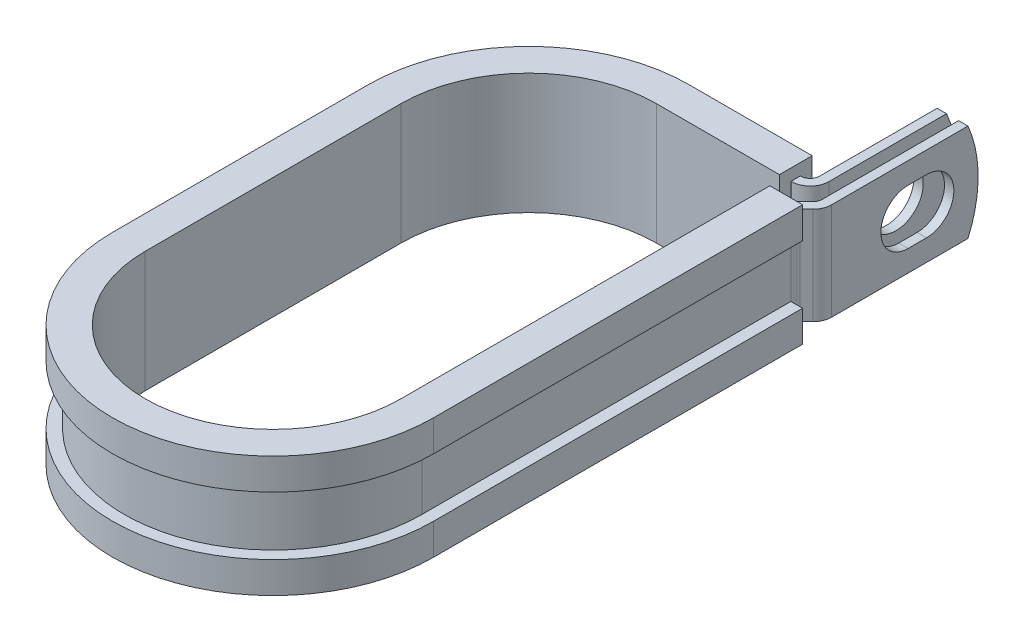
ISO-10303-21;
HEADER;
FILE_DESCRIPTION(('STEP AP214'),'2;1');
FILE_NAME('part.step','',(''),(''),'','','');
FILE_SCHEMA(('AUTOMOTIVE_DESIGN { 1 0 10303 214 1 1 1 1 }'));
ENDSEC;
DATA;
#1=APPLICATION_CONTEXT('core data for automotive mechanical design processes');
#2=APPLICATION_PROTOCOL_DEFINITION('international standard','automotive_design',2000,#1);
#3=PRODUCT_CONTEXT('',#1,'mechanical');
#4=PRODUCT('Part','Part','',(#3));
#5=PRODUCT_RELATED_PRODUCT_CATEGORY('part','',(#4));
#6=PRODUCT_DEFINITION_FORMATION('','',#4);
#7=PRODUCT_DEFINITION_CONTEXT('part definition',#1,'design');
#8=PRODUCT_DEFINITION('design','',#6,#7);
#9=PRODUCT_DEFINITION_SHAPE('','',#8);
#10=(LENGTH_UNIT() NAMED_UNIT(*) SI_UNIT(.MILLI.,.METRE.));
#11=(NAMED_UNIT(*) PLANE_ANGLE_UNIT() SI_UNIT($,.RADIAN.));
#12=(NAMED_UNIT(*) SI_UNIT($,.STERADIAN.) SOLID_ANGLE_UNIT());
#13=UNCERTAINTY_MEASURE_WITH_UNIT(LENGTH_MEASURE(1.E-05),#10,'distance_accuracy_value','');
#14=(GEOMETRIC_REPRESENTATION_CONTEXT(3) GLOBAL_UNCERTAINTY_ASSIGNED_CONTEXT((#13)) GLOBAL_UNIT_ASSIGNED_CONTEXT((#10,
#11,#12)) REPRESENTATION_CONTEXT('',''));
#15=CARTESIAN_POINT('',(0.,0.,0.));
#16=DIRECTION('',(0.,0.,1.));
#17=DIRECTION('',(1.,0.,0.));
#18=AXIS2_PLACEMENT_3D('',#15,#16,#17);
#19=CARTESIAN_POINT('',(18.8646698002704,-6.35,-18.1864));
#20=DIRECTION('',(0.,1.,0.));
#21=DIRECTION('',(1.,0.,0.));
#22=AXIS2_PLACEMENT_3D('',#19,#20,#21);
#23=PLANE('',#22);
#24=DIRECTION('',(0.,0.,-1.));
#25=VECTOR('',#24,1.);
#26=CARTESIAN_POINT('',(16.0198698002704,-6.35,-18.1864));
#27=LINE('',#26,#25);
#28=CARTESIAN_POINT('',(16.0198698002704,-6.35,-18.1864));
#29=VERTEX_POINT('',#28);
#30=CARTESIAN_POINT('',(16.0198698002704,-6.35,-19.4056));
#31=VERTEX_POINT('',#30);
#32=EDGE_CURVE('E582',#29,#31,#27,.T.);
#33=ORIENTED_EDGE('',*,*,#32,.T.);
#34=DIRECTION('',(1.,0.,0.));
#35=VECTOR('',#34,1.);
#36=CARTESIAN_POINT('',(0.,-6.35,-19.4056));
#37=LINE('',#36,#35);
#38=CARTESIAN_POINT('',(16.0706698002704,-6.35,-19.4056));
#39=VERTEX_POINT('',#38);
#40=EDGE_CURVE('E416',#39,#31,#37,.F.);
#41=ORIENTED_EDGE('',*,*,#40,.F.);
#42=CARTESIAN_POINT('',(16.0706698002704,-6.35,-20.6248));
#43=DIRECTION('',(0.,1.,0.));
#44=DIRECTION('',(1.,0.,0.));
#45=AXIS2_PLACEMENT_3D('',#42,#43,#44);
#46=CIRCLE('',#45,1.2192);
#47=CARTESIAN_POINT('',(17.2898698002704,-6.35,-20.6248));
#48=VERTEX_POINT('',#47);
#49=EDGE_CURVE('E414',#48,#39,#46,.F.);
#50=ORIENTED_EDGE('',*,*,#49,.F.);
#51=DIRECTION('',(0.,0.,1.));
#52=VECTOR('',#51,1.);
#53=CARTESIAN_POINT('',(17.2898698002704,-6.35,-37.2872));
#54=LINE('',#53,#52);
#55=CARTESIAN_POINT('',(17.2898698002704,-6.35,-35.9618778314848));
#56=VERTEX_POINT('',#55);
#57=EDGE_CURVE('E412',#56,#48,#54,.T.);
#58=ORIENTED_EDGE('',*,*,#57,.F.);
#59=DIRECTION('',(-1.,0.,0.));
#60=VECTOR('',#59,1.);
#61=CARTESIAN_POINT('',(21.3030698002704,-6.35,-35.9618778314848));
#62=LINE('',#61,#60);
#63=CARTESIAN_POINT('',(18.5090698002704,-6.35,-35.9618778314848));
#64=VERTEX_POINT('',#63);
#65=EDGE_CURVE('E12',#64,#56,#62,.T.);
#66=ORIENTED_EDGE('',*,*,#65,.F.);
#67=DIRECTION('',(0.,0.,1.));
#68=VECTOR('',#67,1.);
#69=CARTESIAN_POINT('',(18.5090698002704,-6.35,-37.2872));
#70=LINE('',#69,#68);
#71=CARTESIAN_POINT('',(18.5090698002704,-6.35,-20.6248));
#72=VERTEX_POINT('',#71);
#73=EDGE_CURVE('E410',#64,#72,#70,.T.);
#74=ORIENTED_EDGE('',*,*,#73,.T.);
#75=CARTESIAN_POINT('',(16.0706698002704,-6.35,-20.6248));
#76=DIRECTION('',(0.,-1.,0.));
#77=DIRECTION('',(0.,0.,1.));
#78=AXIS2_PLACEMENT_3D('',#75,#76,#77);
#79=CIRCLE('',#78,2.4384);
#80=CARTESIAN_POINT('',(16.0706698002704,-6.35,-18.1864));
#81=VERTEX_POINT('',#80);
#82=EDGE_CURVE('E407',#72,#81,#79,.T.);
#83=ORIENTED_EDGE('',*,*,#82,.T.);
#84=DIRECTION('',(-1.,0.,0.));
#85=VECTOR('',#84,1.);
#86=CARTESIAN_POINT('',(0.,-6.35,-18.1864));
#87=LINE('',#86,#85);
#88=EDGE_CURVE('E404',#81,#29,#87,.T.);
#89=ORIENTED_EDGE('',*,*,#88,.T.);
#90=EDGE_LOOP('',(#33,#41,#50,#58,#66,#74,#83,#89));
#91=FACE_BOUND('',#90,.T.);
#92=ADVANCED_FACE('F55',(#91),#23,.F.);
#93=CARTESIAN_POINT('',(18.8646698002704,6.35,-18.1864));
#94=DIRECTION('',(0.,1.,0.));
#95=DIRECTION('',(1.,0.,0.));
#96=AXIS2_PLACEMENT_3D('',#93,#94,#95);
#97=PLANE('',#96);
#98=DIRECTION('',(1.,0.,0.));
#99=VECTOR('',#98,1.);
#100=CARTESIAN_POINT('',(0.,6.35,-19.4056));
#101=LINE('',#100,#99);
#102=CARTESIAN_POINT('',(16.0706698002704,6.35,-19.4056));
#103=VERTEX_POINT('',#102);
#104=CARTESIAN_POINT('',(16.0198698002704,6.35,-19.4056));
#105=VERTEX_POINT('',#104);
#106=EDGE_CURVE('E377',#103,#105,#101,.F.);
#107=ORIENTED_EDGE('',*,*,#106,.T.);
#108=DIRECTION('',(0.,0.,1.));
#109=VECTOR('',#108,1.);
#110=CARTESIAN_POINT('',(16.0198698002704,6.35,-19.4056));
#111=LINE('',#110,#109);
#112=CARTESIAN_POINT('',(16.0198698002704,6.35,-18.1864));
#113=VERTEX_POINT('',#112);
#114=EDGE_CURVE('E588',#105,#113,#111,.T.);
#115=ORIENTED_EDGE('',*,*,#114,.T.);
#116=DIRECTION('',(-1.,0.,0.));
#117=VECTOR('',#116,1.);
#118=CARTESIAN_POINT('',(0.,6.35,-18.1864));
#119=LINE('',#118,#117);
#120=CARTESIAN_POINT('',(16.0706698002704,6.35,-18.1864));
#121=VERTEX_POINT('',#120);
#122=EDGE_CURVE('E479',#121,#113,#119,.T.);
#123=ORIENTED_EDGE('',*,*,#122,.F.);
#124=CARTESIAN_POINT('',(16.0706698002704,6.35,-20.6248));
#125=DIRECTION('',(0.,-1.,0.));
#126=DIRECTION('',(0.,0.,1.));
#127=AXIS2_PLACEMENT_3D('',#124,#125,#126);
#128=CIRCLE('',#127,2.4384);
#129=CARTESIAN_POINT('',(18.5090698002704,6.35,-20.6248));
#130=VERTEX_POINT('',#129);
#131=EDGE_CURVE('E474',#130,#121,#128,.T.);
#132=ORIENTED_EDGE('',*,*,#131,.F.);
#133=DIRECTION('',(0.,0.,1.));
#134=VECTOR('',#133,1.);
#135=CARTESIAN_POINT('',(18.5090698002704,6.35,-37.2872));
#136=LINE('',#135,#134);
#137=CARTESIAN_POINT('',(18.5090698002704,6.35,-35.9618778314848));
#138=VERTEX_POINT('',#137);
#139=EDGE_CURVE('E468',#138,#130,#136,.T.);
#140=ORIENTED_EDGE('',*,*,#139,.F.);
#141=DIRECTION('',(-1.,0.,0.));
#142=VECTOR('',#141,1.);
#143=CARTESIAN_POINT('',(21.3030698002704,6.35,-35.9618778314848));
#144=LINE('',#143,#142);
#145=CARTESIAN_POINT('',(17.2898698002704,6.35,-35.9618778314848));
#146=VERTEX_POINT('',#145);
#147=EDGE_CURVE('E63',#138,#146,#144,.T.);
#148=ORIENTED_EDGE('',*,*,#147,.T.);
#149=DIRECTION('',(0.,0.,1.));
#150=VECTOR('',#149,1.);
#151=CARTESIAN_POINT('',(17.2898698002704,6.35,-37.2872));
#152=LINE('',#151,#150);
#153=CARTESIAN_POINT('',(17.2898698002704,6.35,-20.6248));
#154=VERTEX_POINT('',#153);
#155=EDGE_CURVE('E465',#146,#154,#152,.T.);
#156=ORIENTED_EDGE('',*,*,#155,.T.);
#157=CARTESIAN_POINT('',(16.0706698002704,6.35,-20.6248));
#158=DIRECTION('',(0.,1.,0.));
#159=DIRECTION('',(1.,0.,0.));
#160=AXIS2_PLACEMENT_3D('',#157,#158,#159);
#161=CIRCLE('',#160,1.2192);
#162=EDGE_CURVE('E382',#154,#103,#161,.F.);
#163=ORIENTED_EDGE('',*,*,#162,.T.);
#164=EDGE_LOOP('',(#107,#115,#123,#132,#140,#148,#156,#163));
#165=FACE_BOUND('',#164,.T.);
#166=ADVANCED_FACE('F464',(#165),#97,.T.);
#167=CARTESIAN_POINT('',(0.,6.35,-18.1864));
#168=DIRECTION('',(0.,0.,1.));
#169=DIRECTION('',(1.,0.,0.));
#170=AXIS2_PLACEMENT_3D('',#167,#168,#169);
#171=PLANE('',#170);
#172=ORIENTED_EDGE('',*,*,#122,.T.);
#173=DIRECTION('',(0.,-1.,0.));
#174=VECTOR('',#173,1.);
#175=CARTESIAN_POINT('',(16.0198698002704,6.35,-18.1864));
#176=LINE('',#175,#174);
#177=EDGE_CURVE('E585',#113,#29,#176,.T.);
#178=ORIENTED_EDGE('',*,*,#177,.T.);
#179=ORIENTED_EDGE('',*,*,#88,.F.);
#180=DIRECTION('',(0.,-1.,0.));
#181=VECTOR('',#180,1.);
#182=CARTESIAN_POINT('',(16.0706698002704,6.35,-18.1864));
#183=LINE('',#182,#181);
#184=EDGE_CURVE('E452',#121,#81,#183,.T.);
#185=ORIENTED_EDGE('',*,*,#184,.F.);
#186=EDGE_LOOP('',(#172,#178,#179,#185));
#187=FACE_BOUND('',#186,.T.);
#188=ADVANCED_FACE('F789',(#187),#171,.T.);
#189=CARTESIAN_POINT('',(21.3030698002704,6.35,-18.1864));
#190=DIRECTION('',(-1.,0.,0.));
#191=DIRECTION('',(0.,0.,1.));
#192=AXIS2_PLACEMENT_3D('',#189,#190,#191);
#193=PLANE('',#192);
#194=CARTESIAN_POINT('',(21.3030698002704,0.,-30.5561999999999));
#195=DIRECTION('',(1.,0.,0.));
#196=DIRECTION('',(0.,0.,-1.));
#197=AXIS2_PLACEMENT_3D('',#194,#195,#196);
#198=CIRCLE('',#197,3.5687);
#199=CARTESIAN_POINT('',(21.3030698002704,-3.5687,-30.5562000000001));
#200=VERTEX_POINT('',#199);
#201=CARTESIAN_POINT('',(21.3030698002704,3.5687,-30.5562000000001));
#202=VERTEX_POINT('',#201);
#203=EDGE_CURVE('E527',#200,#202,#198,.T.);
#204=ORIENTED_EDGE('',*,*,#203,.F.);
#205=DIRECTION('',(0.,0.,-1.));
#206=VECTOR('',#205,1.);
#207=CARTESIAN_POINT('',(21.3030698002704,-3.5687,-28.1685999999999));
#208=LINE('',#207,#206);
#209=CARTESIAN_POINT('',(21.3030698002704,-3.5687,-28.1685999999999));
#210=VERTEX_POINT('',#209);
#211=EDGE_CURVE('E524',#210,#200,#208,.T.);
#212=ORIENTED_EDGE('',*,*,#211,.F.);
#213=CARTESIAN_POINT('',(21.3030698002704,0.,-28.1685999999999));
#214=DIRECTION('',(1.,0.,0.));
#215=DIRECTION('',(0.,0.,-1.));
#216=AXIS2_PLACEMENT_3D('',#213,#214,#215);
#217=CIRCLE('',#216,3.5687);
#218=CARTESIAN_POINT('',(21.3030698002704,3.5687,-28.1685999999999));
#219=VERTEX_POINT('',#218);
#220=EDGE_CURVE('E521',#219,#210,#217,.T.);
#221=ORIENTED_EDGE('',*,*,#220,.F.);
#222=DIRECTION('',(0.,0.,1.));
#223=VECTOR('',#222,1.);
#224=CARTESIAN_POINT('',(21.3030698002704,3.5687,-28.1685999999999));
#225=LINE('',#224,#223);
#226=EDGE_CURVE('E520',#202,#219,#225,.T.);
#227=ORIENTED_EDGE('',*,*,#226,.F.);
#228=EDGE_LOOP('',(#204,#212,#221,#227));
#229=FACE_BOUND('',#228,.T.);
#230=DIRECTION('',(0.,0.,-1.));
#231=VECTOR('',#230,1.);
#232=CARTESIAN_POINT('',(21.3030698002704,-6.35,-18.1864));
#233=LINE('',#232,#231);
#234=CARTESIAN_POINT('',(21.3030698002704,-6.35,-18.1864));
#235=VERTEX_POINT('',#234);
#236=CARTESIAN_POINT('',(21.3030698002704,-6.35,-35.9618778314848));
#237=VERTEX_POINT('',#236);
#238=EDGE_CURVE('E388',#235,#237,#233,.T.);
#239=ORIENTED_EDGE('',*,*,#238,.T.);
#240=CARTESIAN_POINT('',(21.3030698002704,0.,-21.4122));
#241=DIRECTION('',(-1.,0.,0.));
#242=DIRECTION('',(0.,0.,1.));
#243=AXIS2_PLACEMENT_3D('',#240,#241,#242);
#244=CIRCLE('',#243,15.875);
#245=CARTESIAN_POINT('',(21.3030698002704,6.35,-35.9618778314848));
#246=VERTEX_POINT('',#245);
#247=EDGE_CURVE('E536',#246,#237,#244,.T.);
#248=ORIENTED_EDGE('',*,*,#247,.F.);
#249=DIRECTION('',(0.,0.,-1.));
#250=VECTOR('',#249,1.);
#251=CARTESIAN_POINT('',(21.3030698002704,6.35,-18.1864));
#252=LINE('',#251,#250);
#253=CARTESIAN_POINT('',(21.3030698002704,6.35,-18.1864));
#254=VERTEX_POINT('',#253);
#255=EDGE_CURVE('E425',#254,#246,#252,.T.);
#256=ORIENTED_EDGE('',*,*,#255,.F.);
#257=DIRECTION('',(0.,-1.,0.));
#258=VECTOR('',#257,1.);
#259=CARTESIAN_POINT('',(21.3030698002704,6.35,-18.1864));
#260=LINE('',#259,#258);
#261=EDGE_CURVE('E387',#254,#235,#260,.T.);
#262=ORIENTED_EDGE('',*,*,#261,.T.);
#263=EDGE_LOOP('',(#239,#248,#256,#262));
#264=FACE_BOUND('',#263,.T.);
#265=ADVANCED_FACE('F57',(#229,#264),#193,.F.);
#266=CARTESIAN_POINT('',(20.0838698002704,6.35,-18.1864));
#267=DIRECTION('',(-1.,0.,0.));
#268=DIRECTION('',(0.,0.,1.));
#269=AXIS2_PLACEMENT_3D('',#266,#267,#268);
#270=PLANE('',#269);
#271=DIRECTION('',(0.,0.,-1.));
#272=VECTOR('',#271,1.);
#273=CARTESIAN_POINT('',(20.0838698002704,-3.5687,-28.1685999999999));
#274=LINE('',#273,#272);
#275=CARTESIAN_POINT('',(20.0838698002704,-3.5687,-28.1685999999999));
#276=VERTEX_POINT('',#275);
#277=CARTESIAN_POINT('',(20.0838698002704,-3.5687,-30.5562000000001));
#278=VERTEX_POINT('',#277);
#279=EDGE_CURVE('E505',#276,#278,#274,.T.);
#280=ORIENTED_EDGE('',*,*,#279,.T.);
#281=CARTESIAN_POINT('',(20.0838698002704,0.,-30.5561999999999));
#282=DIRECTION('',(-1.,0.,0.));
#283=DIRECTION('',(0.,0.,1.));
#284=AXIS2_PLACEMENT_3D('',#281,#282,#283);
#285=CIRCLE('',#284,3.5687);
#286=CARTESIAN_POINT('',(20.0838698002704,3.5687,-30.5562000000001));
#287=VERTEX_POINT('',#286);
#288=EDGE_CURVE('E504',#278,#287,#285,.F.);
#289=ORIENTED_EDGE('',*,*,#288,.T.);
#290=DIRECTION('',(0.,0.,1.));
#291=VECTOR('',#290,1.);
#292=CARTESIAN_POINT('',(20.0838698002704,3.5687,-28.1685999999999));
#293=LINE('',#292,#291);
#294=CARTESIAN_POINT('',(20.0838698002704,3.5687,-28.1685999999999));
#295=VERTEX_POINT('',#294);
#296=EDGE_CURVE('E508',#287,#295,#293,.T.);
#297=ORIENTED_EDGE('',*,*,#296,.T.);
#298=CARTESIAN_POINT('',(20.0838698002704,0.,-28.1685999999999));
#299=DIRECTION('',(-1.,0.,0.));
#300=DIRECTION('',(0.,0.,1.));
#301=AXIS2_PLACEMENT_3D('',#298,#299,#300);
#302=CIRCLE('',#301,3.5687);
#303=EDGE_CURVE('E501',#295,#276,#302,.F.);
#304=ORIENTED_EDGE('',*,*,#303,.T.);
#305=EDGE_LOOP('',(#280,#289,#297,#304));
#306=FACE_BOUND('',#305,.T.);
#307=CARTESIAN_POINT('',(20.0838698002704,0.,-21.4122));
#308=DIRECTION('',(-1.,0.,0.));
#309=DIRECTION('',(0.,0.,1.));
#310=AXIS2_PLACEMENT_3D('',#307,#308,#309);
#311=CIRCLE('',#310,15.875);
#312=CARTESIAN_POINT('',(20.0838698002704,6.35,-35.9618778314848));
#313=VERTEX_POINT('',#312);
#314=CARTESIAN_POINT('',(20.0838698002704,-6.35,-35.9618778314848));
#315=VERTEX_POINT('',#314);
#316=EDGE_CURVE('E77',#313,#315,#311,.T.);
#317=ORIENTED_EDGE('',*,*,#316,.T.);
#318=DIRECTION('',(0.,0.,-1.));
#319=VECTOR('',#318,1.);
#320=CARTESIAN_POINT('',(20.0838698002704,-6.35,-18.1864));
#321=LINE('',#320,#319);
#322=CARTESIAN_POINT('',(20.0838698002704,-6.35,-18.1864));
#323=VERTEX_POINT('',#322);
#324=EDGE_CURVE('E391',#323,#315,#321,.T.);
#325=ORIENTED_EDGE('',*,*,#324,.F.);
#326=DIRECTION('',(0.,-1.,0.));
#327=VECTOR('',#326,1.);
#328=CARTESIAN_POINT('',(20.0838698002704,6.35,-18.1864));
#329=LINE('',#328,#327);
#330=CARTESIAN_POINT('',(20.0838698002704,6.35,-18.1864));
#331=VERTEX_POINT('',#330);
#332=EDGE_CURVE('E460',#331,#323,#329,.T.);
#333=ORIENTED_EDGE('',*,*,#332,.F.);
#334=DIRECTION('',(0.,0.,-1.));
#335=VECTOR('',#334,1.);
#336=CARTESIAN_POINT('',(20.0838698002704,6.35,-18.1864));
#337=LINE('',#336,#335);
#338=EDGE_CURVE('E489',#331,#313,#337,.T.);
#339=ORIENTED_EDGE('',*,*,#338,.T.);
#340=EDGE_LOOP('',(#317,#325,#333,#339));
#341=FACE_BOUND('',#340,.T.);
#342=ADVANCED_FACE('F762',(#306,#341),#270,.T.);
#343=CARTESIAN_POINT('',(18.5090698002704,6.35,-37.2872));
#344=DIRECTION('',(1.,0.,0.));
#345=DIRECTION('',(0.,0.,-1.));
#346=AXIS2_PLACEMENT_3D('',#343,#344,#345);
#347=PLANE('',#346);
#348=CARTESIAN_POINT('',(18.5090698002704,0.,-29.3624));
#349=DIRECTION('',(1.,0.,0.));
#350=DIRECTION('',(0.,0.,-1.));
#351=AXIS2_PLACEMENT_3D('',#348,#349,#350);
#352=CIRCLE('',#351,3.5687);
#353=CARTESIAN_POINT('',(18.5090698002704,0.,-25.7937));
#354=VERTEX_POINT('',#353);
#355=EDGE_CURVE('E392',#354,#354,#352,.F.);
#356=ORIENTED_EDGE('',*,*,#355,.T.);
#357=EDGE_LOOP('',(#356));
#358=FACE_BOUND('',#357,.T.);
#359=ORIENTED_EDGE('',*,*,#73,.F.);
#360=CARTESIAN_POINT('',(18.5090698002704,0.,-21.4122));
#361=DIRECTION('',(1.,0.,0.));
#362=DIRECTION('',(0.,0.,-1.));
#363=AXIS2_PLACEMENT_3D('',#360,#361,#362);
#364=CIRCLE('',#363,15.875);
#365=EDGE_CURVE('E532',#64,#138,#364,.T.);
#366=ORIENTED_EDGE('',*,*,#365,.T.);
#367=ORIENTED_EDGE('',*,*,#139,.T.);
#368=DIRECTION('',(0.,-1.,0.));
#369=VECTOR('',#368,1.);
#370=CARTESIAN_POINT('',(18.5090698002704,6.35,-20.6248));
#371=LINE('',#370,#369);
#372=EDGE_CURVE('E449',#130,#72,#371,.T.);
#373=ORIENTED_EDGE('',*,*,#372,.T.);
#374=EDGE_LOOP('',(#359,#366,#367,#373));
#375=FACE_BOUND('',#374,.T.);
#376=ADVANCED_FACE('F797',(#358,#375),#347,.T.);
#377=CARTESIAN_POINT('',(17.2898698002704,6.35,-37.2872));
#378=DIRECTION('',(1.,0.,0.));
#379=DIRECTION('',(0.,0.,-1.));
#380=AXIS2_PLACEMENT_3D('',#377,#378,#379);
#381=PLANE('',#380);
#382=CARTESIAN_POINT('',(17.2898698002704,0.,-29.3624));
#383=DIRECTION('',(-1.,0.,0.));
#384=DIRECTION('',(0.,0.,1.));
#385=AXIS2_PLACEMENT_3D('',#382,#383,#384);
#386=CIRCLE('',#385,3.5687);
#387=CARTESIAN_POINT('',(17.2898698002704,0.,-25.7937));
#388=VERTEX_POINT('',#387);
#389=EDGE_CURVE('E496',#388,#388,#386,.T.);
#390=ORIENTED_EDGE('',*,*,#389,.F.);
#391=EDGE_LOOP('',(#390));
#392=FACE_BOUND('',#391,.T.);
#393=CARTESIAN_POINT('',(17.2898698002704,0.,-21.4122));
#394=DIRECTION('',(-1.,0.,0.));
#395=DIRECTION('',(0.,0.,1.));
#396=AXIS2_PLACEMENT_3D('',#393,#394,#395);
#397=CIRCLE('',#396,15.875);
#398=EDGE_CURVE('E69',#146,#56,#397,.T.);
#399=ORIENTED_EDGE('',*,*,#398,.T.);
#400=ORIENTED_EDGE('',*,*,#57,.T.);
#401=DIRECTION('',(0.,-1.,0.));
#402=VECTOR('',#401,1.);
#403=CARTESIAN_POINT('',(17.2898698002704,6.35,-20.6248));
#404=LINE('',#403,#402);
#405=EDGE_CURVE('E446',#154,#48,#404,.T.);
#406=ORIENTED_EDGE('',*,*,#405,.F.);
#407=ORIENTED_EDGE('',*,*,#155,.F.);
#408=EDGE_LOOP('',(#399,#400,#406,#407));
#409=FACE_BOUND('',#408,.T.);
#410=ADVANCED_FACE('F471',(#392,#409),#381,.F.);
#411=CARTESIAN_POINT('',(20.6248,-6.35,-14.7739026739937));
#412=DIRECTION('',(0.,1.,0.));
#413=DIRECTION('',(1.,0.,0.));
#414=AXIS2_PLACEMENT_3D('',#411,#412,#413);
#415=CIRCLE('',#414,1.2192);
#416=CARTESIAN_POINT('',(19.4056,-6.35,-14.7739026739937));
#417=VERTEX_POINT('',#416);
#418=CARTESIAN_POINT('',(19.7626954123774,-6.35,-15.6360072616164));
#419=VERTEX_POINT('',#418);
#420=EDGE_CURVE('E419',#417,#419,#415,.F.);
#421=ORIENTED_EDGE('',*,*,#420,.F.);
#422=DIRECTION('',(1.,0.,0.));
#423=VECTOR('',#422,1.);
#424=CARTESIAN_POINT('',(18.1864,-6.35,-14.7739026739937));
#425=LINE('',#424,#423);
#426=CARTESIAN_POINT('',(18.1864,-6.35,-14.7739026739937));
#427=VERTEX_POINT('',#426);
#428=EDGE_CURVE('E370',#427,#417,#425,.T.);
#429=ORIENTED_EDGE('',*,*,#428,.F.);
#430=CARTESIAN_POINT('',(20.6248,-6.35,-14.7739026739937));
#431=DIRECTION('',(0.,-1.,0.));
#432=DIRECTION('',(0.,0.,1.));
#433=AXIS2_PLACEMENT_3D('',#430,#431,#432);
#434=CIRCLE('',#433,2.4384);
#435=CARTESIAN_POINT('',(18.9005908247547,-6.35,-16.498111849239));
#436=VERTEX_POINT('',#435);
#437=EDGE_CURVE('E401',#427,#436,#434,.T.);
#438=ORIENTED_EDGE('',*,*,#437,.T.);
#439=DIRECTION('',(0.707106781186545,0.,-0.70710678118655));
#440=VECTOR('',#439,1.);
#441=CARTESIAN_POINT('',(18.9005908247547,-6.35,-16.498111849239));
#442=LINE('',#441,#440);
#443=CARTESIAN_POINT('',(19.7267743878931,-6.35,-17.3242954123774));
#444=VERTEX_POINT('',#443);
#445=EDGE_CURVE('E398',#436,#444,#442,.T.);
#446=ORIENTED_EDGE('',*,*,#445,.T.);
#447=CARTESIAN_POINT('',(18.8646698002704,-6.35,-18.1864));
#448=DIRECTION('',(0.,1.,0.));
#449=DIRECTION('',(0.,0.,1.));
#450=AXIS2_PLACEMENT_3D('',#447,#448,#449);
#451=CIRCLE('',#450,1.2192);
#452=EDGE_CURVE('E395',#444,#323,#451,.T.);
#453=ORIENTED_EDGE('',*,*,#452,.T.);
#454=ORIENTED_EDGE('',*,*,#324,.T.);
#455=DIRECTION('',(-1.,0.,0.));
#456=VECTOR('',#455,1.);
#457=CARTESIAN_POINT('',(21.3030698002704,-6.35,-35.9618778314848));
#458=LINE('',#457,#456);
#459=EDGE_CURVE('E538',#237,#315,#458,.T.);
#460=ORIENTED_EDGE('',*,*,#459,.F.);
#461=ORIENTED_EDGE('',*,*,#238,.F.);
#462=CARTESIAN_POINT('',(18.8646698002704,-6.35,-18.1864));
#463=DIRECTION('',(0.,1.,0.));
#464=DIRECTION('',(1.,0.,0.));
#465=AXIS2_PLACEMENT_3D('',#462,#463,#464);
#466=CIRCLE('',#465,2.4384);
#467=CARTESIAN_POINT('',(20.5888789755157,-6.35,-16.4621908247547));
#468=VERTEX_POINT('',#467);
#469=EDGE_CURVE('E423',#468,#235,#466,.T.);
#470=ORIENTED_EDGE('',*,*,#469,.F.);
#471=DIRECTION('',(0.707106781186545,0.,-0.70710678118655));
#472=VECTOR('',#471,1.);
#473=CARTESIAN_POINT('',(19.7626954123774,-6.35,-15.6360072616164));
#474=LINE('',#473,#472);
#475=EDGE_CURVE('E421',#419,#468,#474,.T.);
#476=ORIENTED_EDGE('',*,*,#475,.F.);
#477=EDGE_LOOP('',(#421,#429,#438,#446,#453,#454,#460,#461,#470,#476));
#478=FACE_BOUND('',#477,.T.);
#479=ADVANCED_FACE('F743',(#478),#23,.F.);
#480=DIRECTION('',(-1.,0.,0.));
#481=VECTOR('',#480,1.);
#482=CARTESIAN_POINT('',(19.4056,6.35,-14.7739026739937));
#483=LINE('',#482,#481);
#484=CARTESIAN_POINT('',(19.4056,6.35,-14.7739026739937));
#485=VERTEX_POINT('',#484);
#486=CARTESIAN_POINT('',(18.1864,6.35,-14.7739026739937));
#487=VERTEX_POINT('',#486);
#488=EDGE_CURVE('E350',#485,#487,#483,.T.);
#489=ORIENTED_EDGE('',*,*,#488,.F.);
#490=CARTESIAN_POINT('',(20.6248,6.35,-14.7739026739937));
#491=DIRECTION('',(0.,1.,0.));
#492=DIRECTION('',(1.,0.,0.));
#493=AXIS2_PLACEMENT_3D('',#490,#491,#492);
#494=CIRCLE('',#493,1.2192);
#495=CARTESIAN_POINT('',(19.7626954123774,6.35,-15.6360072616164));
#496=VERTEX_POINT('',#495);
#497=EDGE_CURVE('E365',#485,#496,#494,.F.);
#498=ORIENTED_EDGE('',*,*,#497,.T.);
#499=DIRECTION('',(0.707106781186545,0.,-0.70710678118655));
#500=VECTOR('',#499,1.);
#501=CARTESIAN_POINT('',(19.7626954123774,6.35,-15.6360072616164));
#502=LINE('',#501,#500);
#503=CARTESIAN_POINT('',(20.5888789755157,6.35,-16.4621908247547));
#504=VERTEX_POINT('',#503);
#505=EDGE_CURVE('E376',#496,#504,#502,.T.);
#506=ORIENTED_EDGE('',*,*,#505,.T.);
#507=CARTESIAN_POINT('',(18.8646698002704,6.35,-18.1864));
#508=DIRECTION('',(0.,1.,0.));
#509=DIRECTION('',(1.,0.,0.));
#510=AXIS2_PLACEMENT_3D('',#507,#508,#509);
#511=CIRCLE('',#510,2.4384);
#512=EDGE_CURVE('E379',#504,#254,#511,.T.);
#513=ORIENTED_EDGE('',*,*,#512,.T.);
#514=ORIENTED_EDGE('',*,*,#255,.T.);
#515=DIRECTION('',(-1.,0.,0.));
#516=VECTOR('',#515,1.);
#517=CARTESIAN_POINT('',(21.3030698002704,6.35,-35.9618778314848));
#518=LINE('',#517,#516);
#519=EDGE_CURVE('E534',#246,#313,#518,.T.);
#520=ORIENTED_EDGE('',*,*,#519,.T.);
#521=ORIENTED_EDGE('',*,*,#338,.F.);
#522=CARTESIAN_POINT('',(18.8646698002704,6.35,-18.1864));
#523=DIRECTION('',(0.,1.,0.));
#524=DIRECTION('',(0.,0.,1.));
#525=AXIS2_PLACEMENT_3D('',#522,#523,#524);
#526=CIRCLE('',#525,1.2192);
#527=CARTESIAN_POINT('',(19.7267743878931,6.35,-17.3242954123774));
#528=VERTEX_POINT('',#527);
#529=EDGE_CURVE('E486',#528,#331,#526,.T.);
#530=ORIENTED_EDGE('',*,*,#529,.F.);
#531=DIRECTION('',(0.707106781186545,0.,-0.70710678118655));
#532=VECTOR('',#531,1.);
#533=CARTESIAN_POINT('',(18.9005908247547,6.35,-16.498111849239));
#534=LINE('',#533,#532);
#535=CARTESIAN_POINT('',(18.9005908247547,6.35,-16.498111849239));
#536=VERTEX_POINT('',#535);
#537=EDGE_CURVE('E483',#536,#528,#534,.T.);
#538=ORIENTED_EDGE('',*,*,#537,.F.);
#539=CARTESIAN_POINT('',(20.6248,6.35,-14.7739026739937));
#540=DIRECTION('',(0.,-1.,0.));
#541=DIRECTION('',(0.,0.,1.));
#542=AXIS2_PLACEMENT_3D('',#539,#540,#541);
#543=CIRCLE('',#542,2.4384);
#544=EDGE_CURVE('E369',#487,#536,#543,.T.);
#545=ORIENTED_EDGE('',*,*,#544,.F.);
#546=EDGE_LOOP('',(#489,#498,#506,#513,#514,#520,#521,#530,#538,#545));
#547=FACE_BOUND('',#546,.T.);
#548=ADVANCED_FACE('F364',(#547),#97,.T.);
#549=CARTESIAN_POINT('',(18.8646698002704,6.35,-18.1864));
#550=DIRECTION('',(0.,-1.,0.));
#551=DIRECTION('',(0.,0.,-1.));
#552=AXIS2_PLACEMENT_3D('',#549,#550,#551);
#553=CYLINDRICAL_SURFACE('',#552,1.2192);
#554=ORIENTED_EDGE('',*,*,#452,.F.);
#555=DIRECTION('',(0.,-1.,0.));
#556=VECTOR('',#555,1.);
#557=CARTESIAN_POINT('',(19.7267743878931,6.35,-17.3242954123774));
#558=LINE('',#557,#556);
#559=EDGE_CURVE('E458',#528,#444,#558,.T.);
#560=ORIENTED_EDGE('',*,*,#559,.F.);
#561=ORIENTED_EDGE('',*,*,#529,.T.);
#562=ORIENTED_EDGE('',*,*,#332,.T.);
#563=EDGE_LOOP('',(#554,#560,#561,#562));
#564=FACE_BOUND('',#563,.T.);
#565=ADVANCED_FACE('F765',(#564),#553,.F.);
#566=CARTESIAN_POINT('',(18.9005908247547,6.35,-16.498111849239));
#567=DIRECTION('',(-0.70710678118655,0.,-0.707106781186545));
#568=DIRECTION('',(-0.707106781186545,0.,0.70710678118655));
#569=AXIS2_PLACEMENT_3D('',#566,#567,#568);
#570=PLANE('',#569);
#571=ORIENTED_EDGE('',*,*,#445,.F.);
#572=DIRECTION('',(0.,-1.,0.));
#573=VECTOR('',#572,1.);
#574=CARTESIAN_POINT('',(18.9005908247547,6.35,-16.498111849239));
#575=LINE('',#574,#573);
#576=EDGE_CURVE('E456',#536,#436,#575,.T.);
#577=ORIENTED_EDGE('',*,*,#576,.F.);
#578=ORIENTED_EDGE('',*,*,#537,.T.);
#579=ORIENTED_EDGE('',*,*,#559,.T.);
#580=EDGE_LOOP('',(#571,#577,#578,#579));
#581=FACE_BOUND('',#580,.T.);
#582=ADVANCED_FACE('F768',(#581),#570,.T.);
#583=CARTESIAN_POINT('',(20.6248,6.35,-14.7739026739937));
#584=DIRECTION('',(0.,-1.,0.));
#585=DIRECTION('',(0.,0.,-1.));
#586=AXIS2_PLACEMENT_3D('',#583,#584,#585);
#587=CYLINDRICAL_SURFACE('',#586,2.4384);
#588=ORIENTED_EDGE('',*,*,#437,.F.);
#589=DIRECTION('',(0.,-1.,0.));
#590=VECTOR('',#589,1.);
#591=CARTESIAN_POINT('',(18.1864,6.35,-14.7739026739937));
#592=LINE('',#591,#590);
#593=EDGE_CURVE('E454',#487,#427,#592,.T.);
#594=ORIENTED_EDGE('',*,*,#593,.F.);
#595=ORIENTED_EDGE('',*,*,#544,.T.);
#596=ORIENTED_EDGE('',*,*,#576,.T.);
#597=EDGE_LOOP('',(#588,#594,#595,#596));
#598=FACE_BOUND('',#597,.T.);
#599=ADVANCED_FACE('F770',(#598),#587,.T.);
#600=CARTESIAN_POINT('',(16.0706698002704,6.35,-20.6248));
#601=DIRECTION('',(0.,-1.,0.));
#602=DIRECTION('',(0.,0.,-1.));
#603=AXIS2_PLACEMENT_3D('',#600,#601,#602);
#604=CYLINDRICAL_SURFACE('',#603,2.4384);
#605=ORIENTED_EDGE('',*,*,#82,.F.);
#606=ORIENTED_EDGE('',*,*,#372,.F.);
#607=ORIENTED_EDGE('',*,*,#131,.T.);
#608=ORIENTED_EDGE('',*,*,#184,.T.);
#609=EDGE_LOOP('',(#605,#606,#607,#608));
#610=FACE_BOUND('',#609,.T.);
#611=ADVANCED_FACE('F772',(#610),#604,.T.);
#612=CARTESIAN_POINT('',(16.0706698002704,6.35,-20.6248));
#613=DIRECTION('',(0.,-1.,0.));
#614=DIRECTION('',(0.,0.,-1.));
#615=AXIS2_PLACEMENT_3D('',#612,#613,#614);
#616=CYLINDRICAL_SURFACE('',#615,1.2192);
#617=ORIENTED_EDGE('',*,*,#49,.T.);
#618=DIRECTION('',(0.,-1.,0.));
#619=VECTOR('',#618,1.);
#620=CARTESIAN_POINT('',(16.0706698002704,6.35,-19.4056));
#621=LINE('',#620,#619);
#622=EDGE_CURVE('E443',#103,#39,#621,.T.);
#623=ORIENTED_EDGE('',*,*,#622,.F.);
#624=ORIENTED_EDGE('',*,*,#162,.F.);
#625=ORIENTED_EDGE('',*,*,#405,.T.);
#626=EDGE_LOOP('',(#617,#623,#624,#625));
#627=FACE_BOUND('',#626,.T.);
#628=ADVANCED_FACE('F778',(#627),#616,.F.);
#629=CARTESIAN_POINT('',(0.,6.35,-19.4056));
#630=DIRECTION('',(0.,0.,1.));
#631=DIRECTION('',(1.,0.,0.));
#632=AXIS2_PLACEMENT_3D('',#629,#630,#631);
#633=PLANE('',#632);
#634=DIRECTION('',(0.,-1.,0.));
#635=VECTOR('',#634,1.);
#636=CARTESIAN_POINT('',(0.,6.35,-19.4056));
#637=LINE('',#636,#635);
#638=CARTESIAN_POINT('',(0.,3.81,-19.4056));
#639=VERTEX_POINT('',#638);
#640=CARTESIAN_POINT('',(0.,-3.81,-19.4056));
#641=VERTEX_POINT('',#640);
#642=EDGE_CURVE('E440',#639,#641,#637,.T.);
#643=ORIENTED_EDGE('',*,*,#642,.F.);
#644=DIRECTION('',(1.,0.,0.));
#645=VECTOR('',#644,1.);
#646=CARTESIAN_POINT('',(0.,3.81,-19.4056));
#647=LINE('',#646,#645);
#648=CARTESIAN_POINT('',(16.0198698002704,3.81,-19.4056));
#649=VERTEX_POINT('',#648);
#650=EDGE_CURVE('E541',#639,#649,#647,.T.);
#651=ORIENTED_EDGE('',*,*,#650,.T.);
#652=DIRECTION('',(0.,1.,0.));
#653=VECTOR('',#652,1.);
#654=CARTESIAN_POINT('',(16.0198698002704,6.35,-19.4056));
#655=LINE('',#654,#653);
#656=EDGE_CURVE('E591',#649,#105,#655,.T.);
#657=ORIENTED_EDGE('',*,*,#656,.T.);
#658=ORIENTED_EDGE('',*,*,#106,.F.);
#659=ORIENTED_EDGE('',*,*,#622,.T.);
#660=ORIENTED_EDGE('',*,*,#40,.T.);
#661=DIRECTION('',(0.,1.,0.));
#662=VECTOR('',#661,1.);
#663=CARTESIAN_POINT('',(16.0198698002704,-6.35,-19.4056));
#664=LINE('',#663,#662);
#665=CARTESIAN_POINT('',(16.0198698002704,-3.81,-19.4056));
#666=VERTEX_POINT('',#665);
#667=EDGE_CURVE('E579',#31,#666,#664,.T.);
#668=ORIENTED_EDGE('',*,*,#667,.T.);
#669=DIRECTION('',(1.,0.,0.));
#670=VECTOR('',#669,1.);
#671=CARTESIAN_POINT('',(0.,-3.81,-19.4056));
#672=LINE('',#671,#670);
#673=EDGE_CURVE('E562',#641,#666,#672,.T.);
#674=ORIENTED_EDGE('',*,*,#673,.F.);
#675=EDGE_LOOP('',(#643,#651,#657,#658,#659,#660,#668,#674));
#676=FACE_BOUND('',#675,.T.);
#677=ADVANCED_FACE('F830',(#676),#633,.F.);
#678=CARTESIAN_POINT('',(0.,6.35,0.));
#679=DIRECTION('',(0.,-1.,0.));
#680=DIRECTION('',(0.,0.,-1.));
#681=AXIS2_PLACEMENT_3D('',#678,#679,#680);
#682=CYLINDRICAL_SURFACE('',#681,19.4056);
#683=DIRECTION('',(0.,-1.,0.));
#684=VECTOR('',#683,1.);
#685=CARTESIAN_POINT('',(-19.4056,6.35,0.));
#686=LINE('',#685,#684);
#687=CARTESIAN_POINT('',(-19.4056,3.81,0.));
#688=VERTEX_POINT('',#687);
#689=CARTESIAN_POINT('',(-19.4056,-3.81,0.));
#690=VERTEX_POINT('',#689);
#691=EDGE_CURVE('E437',#688,#690,#686,.T.);
#692=ORIENTED_EDGE('',*,*,#691,.F.);
#693=CARTESIAN_POINT('',(0.,3.81,0.));
#694=DIRECTION('',(0.,-1.,0.));
#695=DIRECTION('',(0.,0.,-1.));
#696=AXIS2_PLACEMENT_3D('',#693,#694,#695);
#697=CIRCLE('',#696,19.4056);
#698=EDGE_CURVE('E594',#688,#639,#697,.T.);
#699=ORIENTED_EDGE('',*,*,#698,.T.);
#700=ORIENTED_EDGE('',*,*,#642,.T.);
#701=CARTESIAN_POINT('',(0.,-3.81,0.));
#702=DIRECTION('',(0.,-1.,0.));
#703=DIRECTION('',(0.,0.,-1.));
#704=AXIS2_PLACEMENT_3D('',#701,#702,#703);
#705=CIRCLE('',#704,19.4056);
#706=EDGE_CURVE('E615',#690,#641,#705,.T.);
#707=ORIENTED_EDGE('',*,*,#706,.F.);
#708=EDGE_LOOP('',(#692,#699,#700,#707));
#709=FACE_BOUND('',#708,.T.);
#710=ADVANCED_FACE('F841',(#709),#682,.T.);
#711=CARTESIAN_POINT('',(-19.4056,6.35,0.));
#712=DIRECTION('',(1.,0.,0.));
#713=DIRECTION('',(0.,0.,-1.));
#714=AXIS2_PLACEMENT_3D('',#711,#712,#713);
#715=PLANE('',#714);
#716=DIRECTION('',(0.,-1.,0.));
#717=VECTOR('',#716,1.);
#718=CARTESIAN_POINT('',(-19.4056,6.35,33.3248));
#719=LINE('',#718,#717);
#720=CARTESIAN_POINT('',(-19.4056,3.81,33.3248));
#721=VERTEX_POINT('',#720);
#722=CARTESIAN_POINT('',(-19.4056,-3.81,33.3248));
#723=VERTEX_POINT('',#722);
#724=EDGE_CURVE('E434',#721,#723,#719,.T.);
#725=ORIENTED_EDGE('',*,*,#724,.F.);
#726=DIRECTION('',(0.,0.,-1.));
#727=VECTOR('',#726,1.);
#728=CARTESIAN_POINT('',(-19.4056,3.81,33.3248));
#729=LINE('',#728,#727);
#730=EDGE_CURVE('E626',#721,#688,#729,.T.);
#731=ORIENTED_EDGE('',*,*,#730,.T.);
#732=ORIENTED_EDGE('',*,*,#691,.T.);
#733=DIRECTION('',(0.,0.,-1.));
#734=VECTOR('',#733,1.);
#735=CARTESIAN_POINT('',(-19.4056,-3.81,33.3248));
#736=LINE('',#735,#734);
#737=EDGE_CURVE('E647',#723,#690,#736,.T.);
#738=ORIENTED_EDGE('',*,*,#737,.F.);
#739=EDGE_LOOP('',(#725,#731,#732,#738));
#740=FACE_BOUND('',#739,.T.);
#741=ADVANCED_FACE('F846',(#740),#715,.F.);
#742=CARTESIAN_POINT('',(0.,6.35,33.3248));
#743=DIRECTION('',(0.,-1.,0.));
#744=DIRECTION('',(0.,0.,-1.));
#745=AXIS2_PLACEMENT_3D('',#742,#743,#744);
#746=CYLINDRICAL_SURFACE('',#745,19.4056);
#747=DIRECTION('',(0.,-1.,0.));
#748=VECTOR('',#747,1.);
#749=CARTESIAN_POINT('',(19.4056,6.35,33.3248));
#750=LINE('',#749,#748);
#751=CARTESIAN_POINT('',(19.4056,3.81,33.3248));
#752=VERTEX_POINT('',#751);
#753=CARTESIAN_POINT('',(19.4056,-3.81,33.3248));
#754=VERTEX_POINT('',#753);
#755=EDGE_CURVE('E359',#752,#754,#750,.T.);
#756=ORIENTED_EDGE('',*,*,#755,.F.);
#757=CARTESIAN_POINT('',(0.,3.81,33.3248));
#758=DIRECTION('',(0.,-1.,0.));
#759=DIRECTION('',(0.,0.,-1.));
#760=AXIS2_PLACEMENT_3D('',#757,#758,#759);
#761=CIRCLE('',#760,19.4056);
#762=EDGE_CURVE('E658',#752,#721,#761,.T.);
#763=ORIENTED_EDGE('',*,*,#762,.T.);
#764=ORIENTED_EDGE('',*,*,#724,.T.);
#765=CARTESIAN_POINT('',(0.,-3.81,33.3248));
#766=DIRECTION('',(0.,-1.,0.));
#767=DIRECTION('',(0.,0.,-1.));
#768=AXIS2_PLACEMENT_3D('',#765,#766,#767);
#769=CIRCLE('',#768,19.4056);
#770=EDGE_CURVE('E679',#754,#723,#769,.T.);
#771=ORIENTED_EDGE('',*,*,#770,.F.);
#772=EDGE_LOOP('',(#756,#763,#764,#771));
#773=FACE_BOUND('',#772,.T.);
#774=ADVANCED_FACE('F851',(#773),#746,.T.);
#775=CARTESIAN_POINT('',(19.4056,6.35,0.));
#776=DIRECTION('',(-1.,0.,0.));
#777=DIRECTION('',(0.,0.,1.));
#778=AXIS2_PLACEMENT_3D('',#775,#776,#777);
#779=PLANE('',#778);
#780=DIRECTION('',(0.,-1.,0.));
#781=VECTOR('',#780,1.);
#782=CARTESIAN_POINT('',(19.4056,6.35,-14.7739026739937));
#783=LINE('',#782,#781);
#784=CARTESIAN_POINT('',(19.4056,3.81,-14.7739026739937));
#785=VERTEX_POINT('',#784);
#786=CARTESIAN_POINT('',(19.4056,-3.81,-14.7739026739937));
#787=VERTEX_POINT('',#786);
#788=EDGE_CURVE('E360',#785,#787,#783,.T.);
#789=ORIENTED_EDGE('',*,*,#788,.F.);
#790=DIRECTION('',(0.,0.,-1.));
#791=VECTOR('',#790,1.);
#792=CARTESIAN_POINT('',(19.4056,3.81,0.));
#793=LINE('',#792,#791);
#794=EDGE_CURVE('E699',#752,#785,#793,.T.);
#795=ORIENTED_EDGE('',*,*,#794,.F.);
#796=ORIENTED_EDGE('',*,*,#755,.T.);
#797=DIRECTION('',(0.,0.,-1.));
#798=VECTOR('',#797,1.);
#799=CARTESIAN_POINT('',(19.4056,-3.81,0.));
#800=LINE('',#799,#798);
#801=EDGE_CURVE('E700',#754,#787,#800,.T.);
#802=ORIENTED_EDGE('',*,*,#801,.T.);
#803=EDGE_LOOP('',(#789,#795,#796,#802));
#804=FACE_BOUND('',#803,.T.);
#805=ADVANCED_FACE('F854',(#804),#779,.F.);
#806=CARTESIAN_POINT('',(20.6248,6.35,-14.7739026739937));
#807=DIRECTION('',(0.,-1.,0.));
#808=DIRECTION('',(0.,0.,-1.));
#809=AXIS2_PLACEMENT_3D('',#806,#807,#808);
#810=CYLINDRICAL_SURFACE('',#809,1.2192);
#811=ORIENTED_EDGE('',*,*,#420,.T.);
#812=DIRECTION('',(0.,-1.,0.));
#813=VECTOR('',#812,1.);
#814=CARTESIAN_POINT('',(19.7626954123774,6.35,-15.6360072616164));
#815=LINE('',#814,#813);
#816=EDGE_CURVE('E374',#496,#419,#815,.T.);
#817=ORIENTED_EDGE('',*,*,#816,.F.);
#818=ORIENTED_EDGE('',*,*,#497,.F.);
#819=EDGE_CURVE('E347',#485,#785,#783,.T.);
#820=ORIENTED_EDGE('',*,*,#819,.T.);
#821=ORIENTED_EDGE('',*,*,#788,.T.);
#822=DIRECTION('',(0.,1.,0.));
#823=VECTOR('',#822,1.);
#824=CARTESIAN_POINT('',(19.4056,-6.35,-14.7739026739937));
#825=LINE('',#824,#823);
#826=EDGE_CURVE('E734',#417,#787,#825,.T.);
#827=ORIENTED_EDGE('',*,*,#826,.F.);
#828=EDGE_LOOP('',(#811,#817,#818,#820,#821,#827));
#829=FACE_BOUND('',#828,.T.);
#830=ADVANCED_FACE('F372',(#829),#810,.F.);
#831=CARTESIAN_POINT('',(19.7626954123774,6.35,-15.6360072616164));
#832=DIRECTION('',(-0.70710678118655,0.,-0.707106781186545));
#833=DIRECTION('',(-0.707106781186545,0.,0.70710678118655));
#834=AXIS2_PLACEMENT_3D('',#831,#832,#833);
#835=PLANE('',#834);
#836=ORIENTED_EDGE('',*,*,#475,.T.);
#837=DIRECTION('',(0.,-1.,0.));
#838=VECTOR('',#837,1.);
#839=CARTESIAN_POINT('',(20.5888789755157,6.35,-16.4621908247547));
#840=LINE('',#839,#838);
#841=EDGE_CURVE('E428',#504,#468,#840,.T.);
#842=ORIENTED_EDGE('',*,*,#841,.F.);
#843=ORIENTED_EDGE('',*,*,#505,.F.);
#844=ORIENTED_EDGE('',*,*,#816,.T.);
#845=EDGE_LOOP('',(#836,#842,#843,#844));
#846=FACE_BOUND('',#845,.T.);
#847=ADVANCED_FACE('F748',(#846),#835,.F.);
#848=CARTESIAN_POINT('',(18.8646698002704,6.35,-18.1864));
#849=DIRECTION('',(0.,-1.,0.));
#850=DIRECTION('',(0.,0.,-1.));
#851=AXIS2_PLACEMENT_3D('',#848,#849,#850);
#852=CYLINDRICAL_SURFACE('',#851,2.4384);
#853=ORIENTED_EDGE('',*,*,#469,.T.);
#854=ORIENTED_EDGE('',*,*,#261,.F.);
#855=ORIENTED_EDGE('',*,*,#512,.F.);
#856=ORIENTED_EDGE('',*,*,#841,.T.);
#857=EDGE_LOOP('',(#853,#854,#855,#856));
#858=FACE_BOUND('',#857,.T.);
#859=ADVANCED_FACE('F751',(#858),#852,.T.);
#860=CARTESIAN_POINT('',(28.6028776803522,0.,-29.3624));
#861=DIRECTION('',(-1.,0.,0.));
#862=DIRECTION('',(0.,0.,1.));
#863=AXIS2_PLACEMENT_3D('',#860,#861,#862);
#864=CYLINDRICAL_SURFACE('',#863,3.5687);
#865=CARTESIAN_POINT('',(17.2898698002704,0.,-25.7937));
#866=CARTESIAN_POINT('',(17.3025698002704,0.,-25.7937));
#867=CARTESIAN_POINT('',(17.3152698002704,0.,-25.7937));
#868=CARTESIAN_POINT('',(17.3406698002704,0.,-25.7937));
#869=CARTESIAN_POINT('',(17.3533698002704,0.,-25.7937));
#870=CARTESIAN_POINT('',(17.3787698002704,0.,-25.7937));
#871=CARTESIAN_POINT('',(17.3914698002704,0.,-25.7937));
#872=CARTESIAN_POINT('',(17.4168698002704,0.,-25.7937));
#873=CARTESIAN_POINT('',(17.4295698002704,0.,-25.7937));
#874=CARTESIAN_POINT('',(17.4549698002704,0.,-25.7937));
#875=CARTESIAN_POINT('',(17.4676698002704,0.,-25.7937));
#876=CARTESIAN_POINT('',(17.4930698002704,0.,-25.7937));
#877=CARTESIAN_POINT('',(17.5057698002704,0.,-25.7937));
#878=CARTESIAN_POINT('',(17.5311698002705,0.,-25.7937));
#879=CARTESIAN_POINT('',(17.5438698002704,0.,-25.7937));
#880=CARTESIAN_POINT('',(17.5692698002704,0.,-25.7937));
#881=CARTESIAN_POINT('',(17.5819698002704,0.,-25.7937));
#882=CARTESIAN_POINT('',(17.6073698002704,0.,-25.7937));
#883=CARTESIAN_POINT('',(17.6200698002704,0.,-25.7937));
#884=CARTESIAN_POINT('',(17.6454698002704,0.,-25.7937));
#885=CARTESIAN_POINT('',(17.6581698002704,0.,-25.7937));
#886=CARTESIAN_POINT('',(17.6835698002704,0.,-25.7937));
#887=CARTESIAN_POINT('',(17.6962698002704,0.,-25.7937));
#888=CARTESIAN_POINT('',(17.7216698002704,0.,-25.7937));
#889=CARTESIAN_POINT('',(17.7343698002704,0.,-25.7937));
#890=CARTESIAN_POINT('',(17.7597698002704,0.,-25.7937));
#891=CARTESIAN_POINT('',(17.7724698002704,0.,-25.7937));
#892=CARTESIAN_POINT('',(17.7978698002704,0.,-25.7937));
#893=CARTESIAN_POINT('',(17.8105698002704,0.,-25.7937));
#894=CARTESIAN_POINT('',(17.8359698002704,0.,-25.7937));
#895=CARTESIAN_POINT('',(17.8486698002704,0.,-25.7937));
#896=CARTESIAN_POINT('',(17.8740698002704,0.,-25.7937));
#897=CARTESIAN_POINT('',(17.8867698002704,0.,-25.7937));
#898=CARTESIAN_POINT('',(17.9121698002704,0.,-25.7937));
#899=CARTESIAN_POINT('',(17.9248698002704,0.,-25.7937));
#900=CARTESIAN_POINT('',(17.9502698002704,0.,-25.7937));
#901=CARTESIAN_POINT('',(17.9629698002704,0.,-25.7937));
#902=CARTESIAN_POINT('',(17.9883698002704,0.,-25.7937));
#903=CARTESIAN_POINT('',(18.0010698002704,0.,-25.7937));
#904=CARTESIAN_POINT('',(18.0264698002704,0.,-25.7937));
#905=CARTESIAN_POINT('',(18.0391698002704,0.,-25.7937));
#906=CARTESIAN_POINT('',(18.0645698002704,0.,-25.7937));
#907=CARTESIAN_POINT('',(18.0772698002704,0.,-25.7937));
#908=CARTESIAN_POINT('',(18.1026698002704,0.,-25.7937));
#909=CARTESIAN_POINT('',(18.1153698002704,0.,-25.7937));
#910=CARTESIAN_POINT('',(18.1407698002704,0.,-25.7937));
#911=CARTESIAN_POINT('',(18.1534698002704,0.,-25.7937));
#912=CARTESIAN_POINT('',(18.1788698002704,0.,-25.7937));
#913=CARTESIAN_POINT('',(18.1915698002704,0.,-25.7937));
#914=CARTESIAN_POINT('',(18.2169698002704,0.,-25.7937));
#915=CARTESIAN_POINT('',(18.2296698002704,0.,-25.7937));
#916=CARTESIAN_POINT('',(18.2550698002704,0.,-25.7937));
#917=CARTESIAN_POINT('',(18.2677698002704,0.,-25.7937));
#918=CARTESIAN_POINT('',(18.2931698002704,0.,-25.7937));
#919=CARTESIAN_POINT('',(18.3058698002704,0.,-25.7937));
#920=CARTESIAN_POINT('',(18.3312698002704,0.,-25.7937));
#921=CARTESIAN_POINT('',(18.3439698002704,0.,-25.7937));
#922=CARTESIAN_POINT('',(18.3693698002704,0.,-25.7937));
#923=CARTESIAN_POINT('',(18.3820698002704,0.,-25.7937));
#924=CARTESIAN_POINT('',(18.4074698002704,0.,-25.7937));
#925=CARTESIAN_POINT('',(18.4201698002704,0.,-25.7937));
#926=CARTESIAN_POINT('',(18.4455698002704,0.,-25.7937));
#927=CARTESIAN_POINT('',(18.4582698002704,0.,-25.7937));
#928=CARTESIAN_POINT('',(18.4836698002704,0.,-25.7937));
#929=CARTESIAN_POINT('',(18.4963698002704,0.,-25.7937));
#930=CARTESIAN_POINT('',(18.5090698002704,0.,-25.7937));
#931=B_SPLINE_CURVE_WITH_KNOTS('',3,(#865,#866,#867,#868,#869,#870,#871,#872,#873,#874,#875,
#876,#877,#878,#879,#880,#881,#882,#883,#884,#885,#886,#887,#888,#889,#890,#891,#892,#893,#894,
#895,#896,#897,#898,#899,#900,#901,#902,#903,#904,#905,#906,#907,#908,#909,#910,#911,#912,#913,
#914,#915,#916,#917,#918,#919,#920,#921,#922,#923,#924,#925,#926,#927,#928,#929,#930),
.UNSPECIFIED.,.F.,.F.,(4,2,2,2,2,2,2,2,2,2,2,2,2,2,2,2,2,2,2,2,2,2,2,2,2,2,2,2,2,2,2,2,4),(0.,
0.0380999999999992,0.0761999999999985,0.114300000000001,0.1524,0.1905,0.228600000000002,
0.266700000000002,0.304800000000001,0.3429,0.380999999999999,0.419099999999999,
0.457199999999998,0.495299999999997,0.533399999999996,0.571499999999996,0.609599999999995,
0.647699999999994,0.685799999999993,0.723899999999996,0.761999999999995,0.800099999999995,
0.838199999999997,0.876299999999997,0.914399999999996,0.952499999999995,0.990599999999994,
1.02869999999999,1.06679999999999,1.10489999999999,1.14299999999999,1.18109999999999,
1.21919999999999),.UNSPECIFIED.);
#932=EDGE_CURVE('BSEAM965',#388,#354,#931,.T.);
#933=ORIENTED_EDGE('',*,*,#389,.T.);
#934=ORIENTED_EDGE('',*,*,#355,.F.);
#935=ORIENTED_EDGE('',*,*,#932,.T.);
#936=ORIENTED_EDGE('',*,*,#932,.F.);
#937=EDGE_LOOP('',(#933,#935,#934,#936));
#938=FACE_BOUND('',#937,.T.);
#939=ADVANCED_FACE('F965',(#938),#864,.F.);
#940=CARTESIAN_POINT('',(8.18142871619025,-3.5687,-28.1685999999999));
#941=DIRECTION('',(0.,-1.,0.));
#942=DIRECTION('',(0.,0.,-1.));
#943=AXIS2_PLACEMENT_3D('',#940,#941,#942);
#944=PLANE('',#943);
#945=DIRECTION('',(1.,0.,0.));
#946=VECTOR('',#945,1.);
#947=CARTESIAN_POINT('',(8.18142871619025,-3.5687,-28.1685999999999));
#948=LINE('',#947,#946);
#949=EDGE_CURVE('E499',#276,#210,#948,.T.);
#950=ORIENTED_EDGE('',*,*,#949,.T.);
#951=ORIENTED_EDGE('',*,*,#211,.T.);
#952=DIRECTION('',(1.,0.,0.));
#953=VECTOR('',#952,1.);
#954=CARTESIAN_POINT('',(8.18142871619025,-3.5687,-30.5562000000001));
#955=LINE('',#954,#953);
#956=EDGE_CURVE('E502',#278,#200,#955,.T.);
#957=ORIENTED_EDGE('',*,*,#956,.F.);
#958=ORIENTED_EDGE('',*,*,#279,.F.);
#959=EDGE_LOOP('',(#950,#951,#957,#958));
#960=FACE_BOUND('',#959,.T.);
#961=ADVANCED_FACE('F961',(#960),#944,.F.);
#962=CARTESIAN_POINT('',(8.18142871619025,0.,-30.5561999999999));
#963=DIRECTION('',(1.,0.,0.));
#964=DIRECTION('',(0.,0.,-1.));
#965=AXIS2_PLACEMENT_3D('',#962,#963,#964);
#966=CYLINDRICAL_SURFACE('',#965,3.5687);
#967=ORIENTED_EDGE('',*,*,#956,.T.);
#968=ORIENTED_EDGE('',*,*,#203,.T.);
#969=DIRECTION('',(1.,0.,0.));
#970=VECTOR('',#969,1.);
#971=CARTESIAN_POINT('',(8.18142871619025,3.5687,-30.5562000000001));
#972=LINE('',#971,#970);
#973=EDGE_CURVE('E506',#287,#202,#972,.T.);
#974=ORIENTED_EDGE('',*,*,#973,.F.);
#975=ORIENTED_EDGE('',*,*,#288,.F.);
#976=EDGE_LOOP('',(#967,#968,#974,#975));
#977=FACE_BOUND('',#976,.T.);
#978=ADVANCED_FACE('F957',(#977),#966,.F.);
#979=CARTESIAN_POINT('',(8.18142871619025,3.5687,-28.1685999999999));
#980=DIRECTION('',(0.,1.,0.));
#981=DIRECTION('',(0.,0.,1.));
#982=AXIS2_PLACEMENT_3D('',#979,#980,#981);
#983=PLANE('',#982);
#984=ORIENTED_EDGE('',*,*,#973,.T.);
#985=ORIENTED_EDGE('',*,*,#226,.T.);
#986=DIRECTION('',(1.,0.,0.));
#987=VECTOR('',#986,1.);
#988=CARTESIAN_POINT('',(8.18142871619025,3.5687,-28.1685999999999));
#989=LINE('',#988,#987);
#990=EDGE_CURVE('E509',#295,#219,#989,.T.);
#991=ORIENTED_EDGE('',*,*,#990,.F.);
#992=ORIENTED_EDGE('',*,*,#296,.F.);
#993=EDGE_LOOP('',(#984,#985,#991,#992));
#994=FACE_BOUND('',#993,.T.);
#995=ADVANCED_FACE('F953',(#994),#983,.F.);
#996=CARTESIAN_POINT('',(8.18142871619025,0.,-28.1685999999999));
#997=DIRECTION('',(1.,0.,0.));
#998=DIRECTION('',(0.,0.,-1.));
#999=AXIS2_PLACEMENT_3D('',#996,#997,#998);
#1000=CYLINDRICAL_SURFACE('',#999,3.5687);
#1001=ORIENTED_EDGE('',*,*,#990,.T.);
#1002=ORIENTED_EDGE('',*,*,#220,.T.);
#1003=ORIENTED_EDGE('',*,*,#949,.F.);
#1004=ORIENTED_EDGE('',*,*,#303,.F.);
#1005=EDGE_LOOP('',(#1001,#1002,#1003,#1004));
#1006=FACE_BOUND('',#1005,.T.);
#1007=ADVANCED_FACE('F950',(#1006),#1000,.F.);
#1008=CARTESIAN_POINT('',(21.3030698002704,0.,-21.4122));
#1009=DIRECTION('',(-1.,0.,0.));
#1010=DIRECTION('',(0.,0.,1.));
#1011=AXIS2_PLACEMENT_3D('',#1008,#1009,#1010);
#1012=CYLINDRICAL_SURFACE('',#1011,15.875);
#1013=ORIENTED_EDGE('',*,*,#365,.F.);
#1014=ORIENTED_EDGE('',*,*,#65,.T.);
#1015=ORIENTED_EDGE('',*,*,#398,.F.);
#1016=ORIENTED_EDGE('',*,*,#147,.F.);
#1017=EDGE_LOOP('',(#1013,#1014,#1015,#1016));
#1018=FACE_BOUND('',#1017,.T.);
#1019=ADVANCED_FACE('F821',(#1018),#1012,.T.);
#1020=ORIENTED_EDGE('',*,*,#519,.F.);
#1021=ORIENTED_EDGE('',*,*,#247,.T.);
#1022=ORIENTED_EDGE('',*,*,#459,.T.);
#1023=ORIENTED_EDGE('',*,*,#316,.F.);
#1024=EDGE_LOOP('',(#1020,#1021,#1022,#1023));
#1025=FACE_BOUND('',#1024,.T.);
#1026=ADVANCED_FACE('F758',(#1025),#1012,.T.);
#1027=CARTESIAN_POINT('',(0.,7.874,-20.9296));
#1028=DIRECTION('',(0.,0.,1.));
#1029=DIRECTION('',(1.,0.,0.));
#1030=AXIS2_PLACEMENT_3D('',#1027,#1028,#1029);
#1031=PLANE('',#1030);
#1032=DIRECTION('',(0.,-1.,0.));
#1033=VECTOR('',#1032,1.);
#1034=CARTESIAN_POINT('',(0.,7.874,-20.9296));
#1035=LINE('',#1034,#1033);
#1036=CARTESIAN_POINT('',(0.,7.874,-20.9296));
#1037=VERTEX_POINT('',#1036);
#1038=CARTESIAN_POINT('',(0.,3.81,-20.9296));
#1039=VERTEX_POINT('',#1038);
#1040=EDGE_CURVE('E617',#1037,#1039,#1035,.T.);
#1041=ORIENTED_EDGE('',*,*,#1040,.F.);
#1042=DIRECTION('',(1.,0.,0.));
#1043=VECTOR('',#1042,1.);
#1044=CARTESIAN_POINT('',(0.,7.874,-20.9296));
#1045=LINE('',#1044,#1043);
#1046=CARTESIAN_POINT('',(16.0198698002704,7.874,-20.9296));
#1047=VERTEX_POINT('',#1046);
#1048=EDGE_CURVE('E547',#1037,#1047,#1045,.T.);
#1049=ORIENTED_EDGE('',*,*,#1048,.T.);
#1050=DIRECTION('',(0.,-1.,0.));
#1051=VECTOR('',#1050,1.);
#1052=CARTESIAN_POINT('',(16.0198698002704,7.874,-20.9296));
#1053=LINE('',#1052,#1051);
#1054=CARTESIAN_POINT('',(16.0198698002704,3.81,-20.9296));
#1055=VERTEX_POINT('',#1054);
#1056=EDGE_CURVE('E567',#1047,#1055,#1053,.T.);
#1057=ORIENTED_EDGE('',*,*,#1056,.T.);
#1058=DIRECTION('',(1.,0.,0.));
#1059=VECTOR('',#1058,1.);
#1060=CARTESIAN_POINT('',(0.,3.81,-20.9296));
#1061=LINE('',#1060,#1059);
#1062=EDGE_CURVE('E544',#1039,#1055,#1061,.T.);
#1063=ORIENTED_EDGE('',*,*,#1062,.F.);
#1064=EDGE_LOOP('',(#1041,#1049,#1057,#1063));
#1065=FACE_BOUND('',#1064,.T.);
#1066=ADVANCED_FACE('F890',(#1065),#1031,.F.);
#1067=CARTESIAN_POINT('',(0.,7.874,-16.6624));
#1068=DIRECTION('',(0.,0.,-1.));
#1069=DIRECTION('',(0.,1.,0.));
#1070=AXIS2_PLACEMENT_3D('',#1067,#1068,#1069);
#1071=PLANE('',#1070);
#1072=DIRECTION('',(0.,1.,0.));
#1073=VECTOR('',#1072,1.);
#1074=CARTESIAN_POINT('',(0.,7.874,-16.6624));
#1075=LINE('',#1074,#1073);
#1076=CARTESIAN_POINT('',(0.,-7.874,-16.6624));
#1077=VERTEX_POINT('',#1076);
#1078=CARTESIAN_POINT('',(0.,7.874,-16.6624));
#1079=VERTEX_POINT('',#1078);
#1080=EDGE_CURVE('E620',#1077,#1079,#1075,.T.);
#1081=ORIENTED_EDGE('',*,*,#1080,.F.);
#1082=DIRECTION('',(1.,0.,0.));
#1083=VECTOR('',#1082,1.);
#1084=CARTESIAN_POINT('',(0.,-7.874,-16.6624));
#1085=LINE('',#1084,#1083);
#1086=CARTESIAN_POINT('',(16.0198698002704,-7.874,-16.6624));
#1087=VERTEX_POINT('',#1086);
#1088=EDGE_CURVE('E553',#1077,#1087,#1085,.T.);
#1089=ORIENTED_EDGE('',*,*,#1088,.T.);
#1090=DIRECTION('',(0.,1.,0.));
#1091=VECTOR('',#1090,1.);
#1092=CARTESIAN_POINT('',(16.0198698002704,7.874,-16.6624));
#1093=LINE('',#1092,#1091);
#1094=CARTESIAN_POINT('',(16.0198698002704,7.874,-16.6624));
#1095=VERTEX_POINT('',#1094);
#1096=EDGE_CURVE('E571',#1087,#1095,#1093,.T.);
#1097=ORIENTED_EDGE('',*,*,#1096,.T.);
#1098=DIRECTION('',(1.,0.,0.));
#1099=VECTOR('',#1098,1.);
#1100=CARTESIAN_POINT('',(0.,7.874,-16.6624));
#1101=LINE('',#1100,#1099);
#1102=EDGE_CURVE('E550',#1079,#1095,#1101,.T.);
#1103=ORIENTED_EDGE('',*,*,#1102,.F.);
#1104=EDGE_LOOP('',(#1081,#1089,#1097,#1103));
#1105=FACE_BOUND('',#1104,.T.);
#1106=ADVANCED_FACE('F896',(#1105),#1071,.F.);
#1107=CARTESIAN_POINT('',(0.,-7.874,-20.9296));
#1108=DIRECTION('',(0.,0.,1.));
#1109=DIRECTION('',(1.,0.,0.));
#1110=AXIS2_PLACEMENT_3D('',#1107,#1108,#1109);
#1111=PLANE('',#1110);
#1112=DIRECTION('',(0.,-1.,0.));
#1113=VECTOR('',#1112,1.);
#1114=CARTESIAN_POINT('',(0.,-7.874,-20.9296));
#1115=LINE('',#1114,#1113);
#1116=CARTESIAN_POINT('',(0.,-3.81,-20.9296));
#1117=VERTEX_POINT('',#1116);
#1118=CARTESIAN_POINT('',(0.,-7.874,-20.9296));
#1119=VERTEX_POINT('',#1118);
#1120=EDGE_CURVE('E623',#1117,#1119,#1115,.T.);
#1121=ORIENTED_EDGE('',*,*,#1120,.F.);
#1122=DIRECTION('',(1.,0.,0.));
#1123=VECTOR('',#1122,1.);
#1124=CARTESIAN_POINT('',(0.,-3.81,-20.9296));
#1125=LINE('',#1124,#1123);
#1126=CARTESIAN_POINT('',(16.0198698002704,-3.81,-20.9296));
#1127=VERTEX_POINT('',#1126);
#1128=EDGE_CURVE('E559',#1117,#1127,#1125,.T.);
#1129=ORIENTED_EDGE('',*,*,#1128,.T.);
#1130=DIRECTION('',(0.,-1.,0.));
#1131=VECTOR('',#1130,1.);
#1132=CARTESIAN_POINT('',(16.0198698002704,-7.874,-20.9296));
#1133=LINE('',#1132,#1131);
#1134=CARTESIAN_POINT('',(16.0198698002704,-7.874,-20.9296));
#1135=VERTEX_POINT('',#1134);
#1136=EDGE_CURVE('E575',#1127,#1135,#1133,.T.);
#1137=ORIENTED_EDGE('',*,*,#1136,.T.);
#1138=DIRECTION('',(1.,0.,0.));
#1139=VECTOR('',#1138,1.);
#1140=CARTESIAN_POINT('',(0.,-7.874,-20.9296));
#1141=LINE('',#1140,#1139);
#1142=EDGE_CURVE('E556',#1119,#1135,#1141,.T.);
#1143=ORIENTED_EDGE('',*,*,#1142,.F.);
#1144=EDGE_LOOP('',(#1121,#1129,#1137,#1143));
#1145=FACE_BOUND('',#1144,.T.);
#1146=ADVANCED_FACE('F904',(#1145),#1111,.F.);
#1147=CARTESIAN_POINT('',(0.,6.35,0.));
#1148=DIRECTION('',(0.,-1.,0.));
#1149=DIRECTION('',(0.,0.,-1.));
#1150=AXIS2_PLACEMENT_3D('',#1147,#1148,#1149);
#1151=CYLINDRICAL_SURFACE('',#1150,20.9296);
#1152=DIRECTION('',(0.,-1.,0.));
#1153=VECTOR('',#1152,1.);
#1154=CARTESIAN_POINT('',(-20.9296,7.874,0.));
#1155=LINE('',#1154,#1153);
#1156=CARTESIAN_POINT('',(-20.9296,7.874,0.));
#1157=VERTEX_POINT('',#1156);
#1158=CARTESIAN_POINT('',(-20.9296,3.81,0.));
#1159=VERTEX_POINT('',#1158);
#1160=EDGE_CURVE('E649',#1157,#1159,#1155,.T.);
#1161=ORIENTED_EDGE('',*,*,#1160,.F.);
#1162=CARTESIAN_POINT('',(0.,7.874,0.));
#1163=DIRECTION('',(0.,-1.,0.));
#1164=DIRECTION('',(0.,0.,-1.));
#1165=AXIS2_PLACEMENT_3D('',#1162,#1163,#1164);
#1166=CIRCLE('',#1165,20.9296);
#1167=EDGE_CURVE('E600',#1157,#1037,#1166,.T.);
#1168=ORIENTED_EDGE('',*,*,#1167,.T.);
#1169=ORIENTED_EDGE('',*,*,#1040,.T.);
#1170=CARTESIAN_POINT('',(0.,3.81,0.));
#1171=DIRECTION('',(0.,-1.,0.));
#1172=DIRECTION('',(0.,0.,-1.));
#1173=AXIS2_PLACEMENT_3D('',#1170,#1171,#1172);
#1174=CIRCLE('',#1173,20.9296);
#1175=EDGE_CURVE('E597',#1159,#1039,#1174,.T.);
#1176=ORIENTED_EDGE('',*,*,#1175,.F.);
#1177=EDGE_LOOP('',(#1161,#1168,#1169,#1176));
#1178=FACE_BOUND('',#1177,.T.);
#1179=ADVANCED_FACE('F887',(#1178),#1151,.T.);
#1180=CARTESIAN_POINT('',(0.,6.35,0.));
#1181=DIRECTION('',(0.,-1.,0.));
#1182=DIRECTION('',(0.,0.,-1.));
#1183=AXIS2_PLACEMENT_3D('',#1180,#1181,#1182);
#1184=CYLINDRICAL_SURFACE('',#1183,16.6624);
#1185=DIRECTION('',(0.,1.,0.));
#1186=VECTOR('',#1185,1.);
#1187=CARTESIAN_POINT('',(-16.6624,7.874,0.));
#1188=LINE('',#1187,#1186);
#1189=CARTESIAN_POINT('',(-16.6624,-7.874,0.));
#1190=VERTEX_POINT('',#1189);
#1191=CARTESIAN_POINT('',(-16.6624,7.874,0.));
#1192=VERTEX_POINT('',#1191);
#1193=EDGE_CURVE('E652',#1190,#1192,#1188,.T.);
#1194=ORIENTED_EDGE('',*,*,#1193,.F.);
#1195=CARTESIAN_POINT('',(0.,-7.874,0.));
#1196=DIRECTION('',(0.,-1.,0.));
#1197=DIRECTION('',(0.,0.,-1.));
#1198=AXIS2_PLACEMENT_3D('',#1195,#1196,#1197);
#1199=CIRCLE('',#1198,16.6624);
#1200=EDGE_CURVE('E606',#1190,#1077,#1199,.T.);
#1201=ORIENTED_EDGE('',*,*,#1200,.T.);
#1202=ORIENTED_EDGE('',*,*,#1080,.T.);
#1203=CARTESIAN_POINT('',(0.,7.874,0.));
#1204=DIRECTION('',(0.,-1.,0.));
#1205=DIRECTION('',(0.,0.,-1.));
#1206=AXIS2_PLACEMENT_3D('',#1203,#1204,#1205);
#1207=CIRCLE('',#1206,16.6624);
#1208=EDGE_CURVE('E603',#1192,#1079,#1207,.T.);
#1209=ORIENTED_EDGE('',*,*,#1208,.F.);
#1210=EDGE_LOOP('',(#1194,#1201,#1202,#1209));
#1211=FACE_BOUND('',#1210,.T.);
#1212=ADVANCED_FACE('F899',(#1211),#1184,.F.);
#1213=CARTESIAN_POINT('',(0.,6.35,0.));
#1214=DIRECTION('',(0.,-1.,0.));
#1215=DIRECTION('',(0.,0.,-1.));
#1216=AXIS2_PLACEMENT_3D('',#1213,#1214,#1215);
#1217=CYLINDRICAL_SURFACE('',#1216,20.9296);
#1218=DIRECTION('',(0.,-1.,0.));
#1219=VECTOR('',#1218,1.);
#1220=CARTESIAN_POINT('',(-20.9296,-7.874,0.));
#1221=LINE('',#1220,#1219);
#1222=CARTESIAN_POINT('',(-20.9296,-3.81,0.));
#1223=VERTEX_POINT('',#1222);
#1224=CARTESIAN_POINT('',(-20.9296,-7.874,0.));
#1225=VERTEX_POINT('',#1224);
#1226=EDGE_CURVE('E655',#1223,#1225,#1221,.T.);
#1227=ORIENTED_EDGE('',*,*,#1226,.F.);
#1228=CARTESIAN_POINT('',(0.,-3.81,0.));
#1229=DIRECTION('',(0.,-1.,0.));
#1230=DIRECTION('',(0.,0.,-1.));
#1231=AXIS2_PLACEMENT_3D('',#1228,#1229,#1230);
#1232=CIRCLE('',#1231,20.9296);
#1233=EDGE_CURVE('E612',#1223,#1117,#1232,.T.);
#1234=ORIENTED_EDGE('',*,*,#1233,.T.);
#1235=ORIENTED_EDGE('',*,*,#1120,.T.);
#1236=CARTESIAN_POINT('',(0.,-7.874,0.));
#1237=DIRECTION('',(0.,-1.,0.));
#1238=DIRECTION('',(0.,0.,-1.));
#1239=AXIS2_PLACEMENT_3D('',#1236,#1237,#1238);
#1240=CIRCLE('',#1239,20.9296);
#1241=EDGE_CURVE('E609',#1225,#1119,#1240,.T.);
#1242=ORIENTED_EDGE('',*,*,#1241,.F.);
#1243=EDGE_LOOP('',(#1227,#1234,#1235,#1242));
#1244=FACE_BOUND('',#1243,.T.);
#1245=ADVANCED_FACE('F908',(#1244),#1217,.T.);
#1246=CARTESIAN_POINT('',(-20.9296,7.874,33.3248));
#1247=DIRECTION('',(1.,0.,0.));
#1248=DIRECTION('',(0.,0.,-1.));
#1249=AXIS2_PLACEMENT_3D('',#1246,#1247,#1248);
#1250=PLANE('',#1249);
#1251=DIRECTION('',(0.,-1.,0.));
#1252=VECTOR('',#1251,1.);
#1253=CARTESIAN_POINT('',(-20.9296,7.874,33.3248));
#1254=LINE('',#1253,#1252);
#1255=CARTESIAN_POINT('',(-20.9296,7.874,33.3248));
#1256=VERTEX_POINT('',#1255);
#1257=CARTESIAN_POINT('',(-20.9296,3.81,33.3248));
#1258=VERTEX_POINT('',#1257);
#1259=EDGE_CURVE('E681',#1256,#1258,#1254,.T.);
#1260=ORIENTED_EDGE('',*,*,#1259,.F.);
#1261=DIRECTION('',(0.,0.,-1.));
#1262=VECTOR('',#1261,1.);
#1263=CARTESIAN_POINT('',(-20.9296,7.874,33.3248));
#1264=LINE('',#1263,#1262);
#1265=EDGE_CURVE('E632',#1256,#1157,#1264,.T.);
#1266=ORIENTED_EDGE('',*,*,#1265,.T.);
#1267=ORIENTED_EDGE('',*,*,#1160,.T.);
#1268=DIRECTION('',(0.,0.,-1.));
#1269=VECTOR('',#1268,1.);
#1270=CARTESIAN_POINT('',(-20.9296,3.81,33.3248));
#1271=LINE('',#1270,#1269);
#1272=EDGE_CURVE('E629',#1258,#1159,#1271,.T.);
#1273=ORIENTED_EDGE('',*,*,#1272,.F.);
#1274=EDGE_LOOP('',(#1260,#1266,#1267,#1273));
#1275=FACE_BOUND('',#1274,.T.);
#1276=ADVANCED_FACE('F884',(#1275),#1250,.F.);
#1277=CARTESIAN_POINT('',(-16.6624,7.874,33.3248));
#1278=DIRECTION('',(-1.,0.,0.));
#1279=DIRECTION('',(0.,-1.,0.));
#1280=AXIS2_PLACEMENT_3D('',#1277,#1278,#1279);
#1281=PLANE('',#1280);
#1282=DIRECTION('',(0.,1.,0.));
#1283=VECTOR('',#1282,1.);
#1284=CARTESIAN_POINT('',(-16.6624,7.874,33.3248));
#1285=LINE('',#1284,#1283);
#1286=CARTESIAN_POINT('',(-16.6624,-7.874,33.3248));
#1287=VERTEX_POINT('',#1286);
#1288=CARTESIAN_POINT('',(-16.6624,7.874,33.3248));
#1289=VERTEX_POINT('',#1288);
#1290=EDGE_CURVE('E684',#1287,#1289,#1285,.T.);
#1291=ORIENTED_EDGE('',*,*,#1290,.F.);
#1292=DIRECTION('',(0.,0.,-1.));
#1293=VECTOR('',#1292,1.);
#1294=CARTESIAN_POINT('',(-16.6624,-7.874,33.3248));
#1295=LINE('',#1294,#1293);
#1296=EDGE_CURVE('E638',#1287,#1190,#1295,.T.);
#1297=ORIENTED_EDGE('',*,*,#1296,.T.);
#1298=ORIENTED_EDGE('',*,*,#1193,.T.);
#1299=DIRECTION('',(0.,0.,-1.));
#1300=VECTOR('',#1299,1.);
#1301=CARTESIAN_POINT('',(-16.6624,7.874,33.3248));
#1302=LINE('',#1301,#1300);
#1303=EDGE_CURVE('E635',#1289,#1192,#1302,.T.);
#1304=ORIENTED_EDGE('',*,*,#1303,.F.);
#1305=EDGE_LOOP('',(#1291,#1297,#1298,#1304));
#1306=FACE_BOUND('',#1305,.T.);
#1307=ADVANCED_FACE('F930',(#1306),#1281,.F.);
#1308=CARTESIAN_POINT('',(-20.9296,-7.874,33.3248));
#1309=DIRECTION('',(1.,0.,0.));
#1310=DIRECTION('',(0.,0.,-1.));
#1311=AXIS2_PLACEMENT_3D('',#1308,#1309,#1310);
#1312=PLANE('',#1311);
#1313=DIRECTION('',(0.,-1.,0.));
#1314=VECTOR('',#1313,1.);
#1315=CARTESIAN_POINT('',(-20.9296,-7.874,33.3248));
#1316=LINE('',#1315,#1314);
#1317=CARTESIAN_POINT('',(-20.9296,-3.81,33.3248));
#1318=VERTEX_POINT('',#1317);
#1319=CARTESIAN_POINT('',(-20.9296,-7.874,33.3248));
#1320=VERTEX_POINT('',#1319);
#1321=EDGE_CURVE('E687',#1318,#1320,#1316,.T.);
#1322=ORIENTED_EDGE('',*,*,#1321,.F.);
#1323=DIRECTION('',(0.,0.,-1.));
#1324=VECTOR('',#1323,1.);
#1325=CARTESIAN_POINT('',(-20.9296,-3.81,33.3248));
#1326=LINE('',#1325,#1324);
#1327=EDGE_CURVE('E644',#1318,#1223,#1326,.T.);
#1328=ORIENTED_EDGE('',*,*,#1327,.T.);
#1329=ORIENTED_EDGE('',*,*,#1226,.T.);
#1330=DIRECTION('',(0.,0.,-1.));
#1331=VECTOR('',#1330,1.);
#1332=CARTESIAN_POINT('',(-20.9296,-7.874,33.3248));
#1333=LINE('',#1332,#1331);
#1334=EDGE_CURVE('E641',#1320,#1225,#1333,.T.);
#1335=ORIENTED_EDGE('',*,*,#1334,.F.);
#1336=EDGE_LOOP('',(#1322,#1328,#1329,#1335));
#1337=FACE_BOUND('',#1336,.T.);
#1338=ADVANCED_FACE('F910',(#1337),#1312,.F.);
#1339=CARTESIAN_POINT('',(0.,6.35,33.3248));
#1340=DIRECTION('',(0.,-1.,0.));
#1341=DIRECTION('',(0.,0.,-1.));
#1342=AXIS2_PLACEMENT_3D('',#1339,#1340,#1341);
#1343=CYLINDRICAL_SURFACE('',#1342,20.9296);
#1344=DIRECTION('',(0.,-1.,0.));
#1345=VECTOR('',#1344,1.);
#1346=CARTESIAN_POINT('',(20.9296,7.874,33.3248));
#1347=LINE('',#1346,#1345);
#1348=CARTESIAN_POINT('',(20.9296,7.874,33.3248));
#1349=VERTEX_POINT('',#1348);
#1350=CARTESIAN_POINT('',(20.9296,3.81,33.3248));
#1351=VERTEX_POINT('',#1350);
#1352=EDGE_CURVE('E690',#1349,#1351,#1347,.T.);
#1353=ORIENTED_EDGE('',*,*,#1352,.F.);
#1354=CARTESIAN_POINT('',(0.,7.874,33.3248));
#1355=DIRECTION('',(0.,-1.,0.));
#1356=DIRECTION('',(0.,0.,-1.));
#1357=AXIS2_PLACEMENT_3D('',#1354,#1355,#1356);
#1358=CIRCLE('',#1357,20.9296);
#1359=EDGE_CURVE('E664',#1349,#1256,#1358,.T.);
#1360=ORIENTED_EDGE('',*,*,#1359,.T.);
#1361=ORIENTED_EDGE('',*,*,#1259,.T.);
#1362=CARTESIAN_POINT('',(0.,3.81,33.3248));
#1363=DIRECTION('',(0.,-1.,0.));
#1364=DIRECTION('',(0.,0.,-1.));
#1365=AXIS2_PLACEMENT_3D('',#1362,#1363,#1364);
#1366=CIRCLE('',#1365,20.9296);
#1367=EDGE_CURVE('E661',#1351,#1258,#1366,.T.);
#1368=ORIENTED_EDGE('',*,*,#1367,.F.);
#1369=EDGE_LOOP('',(#1353,#1360,#1361,#1368));
#1370=FACE_BOUND('',#1369,.T.);
#1371=ADVANCED_FACE('F881',(#1370),#1343,.T.);
#1372=CARTESIAN_POINT('',(0.,6.35,33.3248));
#1373=DIRECTION('',(0.,-1.,0.));
#1374=DIRECTION('',(0.,0.,-1.));
#1375=AXIS2_PLACEMENT_3D('',#1372,#1373,#1374);
#1376=CYLINDRICAL_SURFACE('',#1375,16.6624);
#1377=DIRECTION('',(0.,1.,0.));
#1378=VECTOR('',#1377,1.);
#1379=CARTESIAN_POINT('',(16.6624,7.874,33.3248));
#1380=LINE('',#1379,#1378);
#1381=CARTESIAN_POINT('',(16.6624,-7.874,33.3248));
#1382=VERTEX_POINT('',#1381);
#1383=CARTESIAN_POINT('',(16.6624,7.874,33.3248));
#1384=VERTEX_POINT('',#1383);
#1385=EDGE_CURVE('E693',#1382,#1384,#1380,.T.);
#1386=ORIENTED_EDGE('',*,*,#1385,.F.);
#1387=CARTESIAN_POINT('',(0.,-7.874,33.3248));
#1388=DIRECTION('',(0.,-1.,0.));
#1389=DIRECTION('',(0.,0.,-1.));
#1390=AXIS2_PLACEMENT_3D('',#1387,#1388,#1389);
#1391=CIRCLE('',#1390,16.6624);
#1392=EDGE_CURVE('E670',#1382,#1287,#1391,.T.);
#1393=ORIENTED_EDGE('',*,*,#1392,.T.);
#1394=ORIENTED_EDGE('',*,*,#1290,.T.);
#1395=CARTESIAN_POINT('',(0.,7.874,33.3248));
#1396=DIRECTION('',(0.,-1.,0.));
#1397=DIRECTION('',(0.,0.,-1.));
#1398=AXIS2_PLACEMENT_3D('',#1395,#1396,#1397);
#1399=CIRCLE('',#1398,16.6624);
#1400=EDGE_CURVE('E667',#1384,#1289,#1399,.T.);
#1401=ORIENTED_EDGE('',*,*,#1400,.F.);
#1402=EDGE_LOOP('',(#1386,#1393,#1394,#1401));
#1403=FACE_BOUND('',#1402,.T.);
#1404=ADVANCED_FACE('F914',(#1403),#1376,.F.);
#1405=CARTESIAN_POINT('',(0.,6.35,33.3248));
#1406=DIRECTION('',(0.,-1.,0.));
#1407=DIRECTION('',(0.,0.,-1.));
#1408=AXIS2_PLACEMENT_3D('',#1405,#1406,#1407);
#1409=CYLINDRICAL_SURFACE('',#1408,20.9296);
#1410=DIRECTION('',(0.,-1.,0.));
#1411=VECTOR('',#1410,1.);
#1412=CARTESIAN_POINT('',(20.9296,-7.874,33.3248));
#1413=LINE('',#1412,#1411);
#1414=CARTESIAN_POINT('',(20.9296,-3.81,33.3248));
#1415=VERTEX_POINT('',#1414);
#1416=CARTESIAN_POINT('',(20.9296,-7.874,33.3248));
#1417=VERTEX_POINT('',#1416);
#1418=EDGE_CURVE('E696',#1415,#1417,#1413,.T.);
#1419=ORIENTED_EDGE('',*,*,#1418,.F.);
#1420=CARTESIAN_POINT('',(0.,-3.81,33.3248));
#1421=DIRECTION('',(0.,-1.,0.));
#1422=DIRECTION('',(0.,0.,-1.));
#1423=AXIS2_PLACEMENT_3D('',#1420,#1421,#1422);
#1424=CIRCLE('',#1423,20.9296);
#1425=EDGE_CURVE('E676',#1415,#1318,#1424,.T.);
#1426=ORIENTED_EDGE('',*,*,#1425,.T.);
#1427=ORIENTED_EDGE('',*,*,#1321,.T.);
#1428=CARTESIAN_POINT('',(0.,-7.874,33.3248));
#1429=DIRECTION('',(0.,-1.,0.));
#1430=DIRECTION('',(0.,0.,-1.));
#1431=AXIS2_PLACEMENT_3D('',#1428,#1429,#1430);
#1432=CIRCLE('',#1431,20.9296);
#1433=EDGE_CURVE('E673',#1417,#1320,#1432,.T.);
#1434=ORIENTED_EDGE('',*,*,#1433,.F.);
#1435=EDGE_LOOP('',(#1419,#1426,#1427,#1434));
#1436=FACE_BOUND('',#1435,.T.);
#1437=ADVANCED_FACE('F912',(#1436),#1409,.T.);
#1438=CARTESIAN_POINT('',(20.9296,3.81,0.));
#1439=DIRECTION('',(0.,-1.,0.));
#1440=DIRECTION('',(1.,0.,0.));
#1441=AXIS2_PLACEMENT_3D('',#1438,#1439,#1440);
#1442=PLANE('',#1441);
#1443=DIRECTION('',(-1.,0.,0.));
#1444=VECTOR('',#1443,1.);
#1445=CARTESIAN_POINT('',(20.9296,3.81,-14.7739026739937));
#1446=LINE('',#1445,#1444);
#1447=CARTESIAN_POINT('',(20.9296,3.81,-14.7739026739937));
#1448=VERTEX_POINT('',#1447);
#1449=EDGE_CURVE('E354',#1448,#785,#1446,.T.);
#1450=ORIENTED_EDGE('',*,*,#1449,.F.);
#1451=DIRECTION('',(0.,0.,-1.));
#1452=VECTOR('',#1451,1.);
#1453=CARTESIAN_POINT('',(20.9296,3.81,0.));
#1454=LINE('',#1453,#1452);
#1455=EDGE_CURVE('E713',#1351,#1448,#1454,.T.);
#1456=ORIENTED_EDGE('',*,*,#1455,.F.);
#1457=ORIENTED_EDGE('',*,*,#1367,.T.);
#1458=ORIENTED_EDGE('',*,*,#1272,.T.);
#1459=ORIENTED_EDGE('',*,*,#1175,.T.);
#1460=ORIENTED_EDGE('',*,*,#1062,.T.);
#1461=DIRECTION('',(0.,0.,1.));
#1462=VECTOR('',#1461,1.);
#1463=CARTESIAN_POINT('',(16.0198698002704,3.81,-20.9296));
#1464=LINE('',#1463,#1462);
#1465=EDGE_CURVE('E565',#1055,#649,#1464,.T.);
#1466=ORIENTED_EDGE('',*,*,#1465,.T.);
#1467=ORIENTED_EDGE('',*,*,#650,.F.);
#1468=ORIENTED_EDGE('',*,*,#698,.F.);
#1469=ORIENTED_EDGE('',*,*,#730,.F.);
#1470=ORIENTED_EDGE('',*,*,#762,.F.);
#1471=ORIENTED_EDGE('',*,*,#794,.T.);
#1472=EDGE_LOOP('',(#1450,#1456,#1457,#1458,#1459,#1460,#1466,#1467,#1468,#1469,#1470,#1471));
#1473=FACE_BOUND('',#1472,.T.);
#1474=ADVANCED_FACE('F843',(#1473),#1442,.T.);
#1475=CARTESIAN_POINT('',(20.9296,7.874,0.));
#1476=DIRECTION('',(1.,0.,0.));
#1477=DIRECTION('',(0.,0.,-1.));
#1478=AXIS2_PLACEMENT_3D('',#1475,#1476,#1477);
#1479=PLANE('',#1478);
#1480=DIRECTION('',(0.,-1.,0.));
#1481=VECTOR('',#1480,1.);
#1482=CARTESIAN_POINT('',(20.9296,7.874,-14.7739026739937));
#1483=LINE('',#1482,#1481);
#1484=CARTESIAN_POINT('',(20.9296,7.874,-14.7739026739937));
#1485=VERTEX_POINT('',#1484);
#1486=EDGE_CURVE('E717',#1485,#1448,#1483,.T.);
#1487=ORIENTED_EDGE('',*,*,#1486,.F.);
#1488=DIRECTION('',(0.,0.,-1.));
#1489=VECTOR('',#1488,1.);
#1490=CARTESIAN_POINT('',(20.9296,7.874,0.));
#1491=LINE('',#1490,#1489);
#1492=EDGE_CURVE('E711',#1349,#1485,#1491,.T.);
#1493=ORIENTED_EDGE('',*,*,#1492,.F.);
#1494=ORIENTED_EDGE('',*,*,#1352,.T.);
#1495=ORIENTED_EDGE('',*,*,#1455,.T.);
#1496=EDGE_LOOP('',(#1487,#1493,#1494,#1495));
#1497=FACE_BOUND('',#1496,.T.);
#1498=ADVANCED_FACE('F878',(#1497),#1479,.T.);
#1499=CARTESIAN_POINT('',(20.9296,7.874,0.));
#1500=DIRECTION('',(0.,1.,0.));
#1501=DIRECTION('',(0.,0.,1.));
#1502=AXIS2_PLACEMENT_3D('',#1499,#1500,#1501);
#1503=PLANE('',#1502);
#1504=DIRECTION('',(1.,0.,0.));
#1505=VECTOR('',#1504,1.);
#1506=CARTESIAN_POINT('',(20.9296,7.874,-14.7739026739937));
#1507=LINE('',#1506,#1505);
#1508=CARTESIAN_POINT('',(16.6624,7.874,-14.7739026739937));
#1509=VERTEX_POINT('',#1508);
#1510=EDGE_CURVE('E719',#1509,#1485,#1507,.T.);
#1511=ORIENTED_EDGE('',*,*,#1510,.F.);
#1512=DIRECTION('',(0.,0.,-1.));
#1513=VECTOR('',#1512,1.);
#1514=CARTESIAN_POINT('',(16.6624,7.874,0.));
#1515=LINE('',#1514,#1513);
#1516=EDGE_CURVE('E709',#1384,#1509,#1515,.T.);
#1517=ORIENTED_EDGE('',*,*,#1516,.F.);
#1518=ORIENTED_EDGE('',*,*,#1400,.T.);
#1519=ORIENTED_EDGE('',*,*,#1303,.T.);
#1520=ORIENTED_EDGE('',*,*,#1208,.T.);
#1521=ORIENTED_EDGE('',*,*,#1102,.T.);
#1522=DIRECTION('',(0.,0.,-1.));
#1523=VECTOR('',#1522,1.);
#1524=CARTESIAN_POINT('',(16.0198698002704,7.874,-20.9296));
#1525=LINE('',#1524,#1523);
#1526=EDGE_CURVE('E569',#1095,#1047,#1525,.T.);
#1527=ORIENTED_EDGE('',*,*,#1526,.T.);
#1528=ORIENTED_EDGE('',*,*,#1048,.F.);
#1529=ORIENTED_EDGE('',*,*,#1167,.F.);
#1530=ORIENTED_EDGE('',*,*,#1265,.F.);
#1531=ORIENTED_EDGE('',*,*,#1359,.F.);
#1532=ORIENTED_EDGE('',*,*,#1492,.T.);
#1533=EDGE_LOOP('',(#1511,#1517,#1518,#1519,#1520,#1521,#1527,#1528,#1529,#1530,#1531,#1532));
#1534=FACE_BOUND('',#1533,.T.);
#1535=ADVANCED_FACE('F873',(#1534),#1503,.T.);
#1536=CARTESIAN_POINT('',(16.6624,7.874,0.));
#1537=DIRECTION('',(-1.,0.,0.));
#1538=DIRECTION('',(0.,-1.,0.));
#1539=AXIS2_PLACEMENT_3D('',#1536,#1537,#1538);
#1540=PLANE('',#1539);
#1541=DIRECTION('',(0.,1.,0.));
#1542=VECTOR('',#1541,1.);
#1543=CARTESIAN_POINT('',(16.6624,7.874,-14.7739026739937));
#1544=LINE('',#1543,#1542);
#1545=CARTESIAN_POINT('',(16.6624,-7.874,-14.7739026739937));
#1546=VERTEX_POINT('',#1545);
#1547=EDGE_CURVE('E722',#1546,#1509,#1544,.T.);
#1548=ORIENTED_EDGE('',*,*,#1547,.F.);
#1549=DIRECTION('',(0.,0.,-1.));
#1550=VECTOR('',#1549,1.);
#1551=CARTESIAN_POINT('',(16.6624,-7.874,0.));
#1552=LINE('',#1551,#1550);
#1553=EDGE_CURVE('E707',#1382,#1546,#1552,.T.);
#1554=ORIENTED_EDGE('',*,*,#1553,.F.);
#1555=ORIENTED_EDGE('',*,*,#1385,.T.);
#1556=ORIENTED_EDGE('',*,*,#1516,.T.);
#1557=EDGE_LOOP('',(#1548,#1554,#1555,#1556));
#1558=FACE_BOUND('',#1557,.T.);
#1559=ADVANCED_FACE('F869',(#1558),#1540,.T.);
#1560=CARTESIAN_POINT('',(16.6624,-7.874,0.));
#1561=DIRECTION('',(0.,-1.,0.));
#1562=DIRECTION('',(1.,0.,0.));
#1563=AXIS2_PLACEMENT_3D('',#1560,#1561,#1562);
#1564=PLANE('',#1563);
#1565=DIRECTION('',(-1.,0.,0.));
#1566=VECTOR('',#1565,1.);
#1567=CARTESIAN_POINT('',(16.6624,-7.874,-14.7739026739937));
#1568=LINE('',#1567,#1566);
#1569=CARTESIAN_POINT('',(20.9296,-7.874,-14.7739026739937));
#1570=VERTEX_POINT('',#1569);
#1571=EDGE_CURVE('E725',#1570,#1546,#1568,.T.);
#1572=ORIENTED_EDGE('',*,*,#1571,.F.);
#1573=DIRECTION('',(0.,0.,-1.));
#1574=VECTOR('',#1573,1.);
#1575=CARTESIAN_POINT('',(20.9296,-7.874,0.));
#1576=LINE('',#1575,#1574);
#1577=EDGE_CURVE('E705',#1417,#1570,#1576,.T.);
#1578=ORIENTED_EDGE('',*,*,#1577,.F.);
#1579=ORIENTED_EDGE('',*,*,#1433,.T.);
#1580=ORIENTED_EDGE('',*,*,#1334,.T.);
#1581=ORIENTED_EDGE('',*,*,#1241,.T.);
#1582=ORIENTED_EDGE('',*,*,#1142,.T.);
#1583=DIRECTION('',(0.,0.,1.));
#1584=VECTOR('',#1583,1.);
#1585=CARTESIAN_POINT('',(16.0198698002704,-7.874,-16.6624));
#1586=LINE('',#1585,#1584);
#1587=EDGE_CURVE('E573',#1135,#1087,#1586,.T.);
#1588=ORIENTED_EDGE('',*,*,#1587,.T.);
#1589=ORIENTED_EDGE('',*,*,#1088,.F.);
#1590=ORIENTED_EDGE('',*,*,#1200,.F.);
#1591=ORIENTED_EDGE('',*,*,#1296,.F.);
#1592=ORIENTED_EDGE('',*,*,#1392,.F.);
#1593=ORIENTED_EDGE('',*,*,#1553,.T.);
#1594=EDGE_LOOP('',(#1572,#1578,#1579,#1580,#1581,#1582,#1588,#1589,#1590,#1591,#1592,#1593));
#1595=FACE_BOUND('',#1594,.T.);
#1596=ADVANCED_FACE('F864',(#1595),#1564,.T.);
#1597=CARTESIAN_POINT('',(20.9296,-7.874,0.));
#1598=DIRECTION('',(1.,0.,0.));
#1599=DIRECTION('',(0.,0.,-1.));
#1600=AXIS2_PLACEMENT_3D('',#1597,#1598,#1599);
#1601=PLANE('',#1600);
#1602=DIRECTION('',(0.,-1.,0.));
#1603=VECTOR('',#1602,1.);
#1604=CARTESIAN_POINT('',(20.9296,-7.874,-14.7739026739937));
#1605=LINE('',#1604,#1603);
#1606=CARTESIAN_POINT('',(20.9296,-3.81,-14.7739026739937));
#1607=VERTEX_POINT('',#1606);
#1608=EDGE_CURVE('E728',#1607,#1570,#1605,.T.);
#1609=ORIENTED_EDGE('',*,*,#1608,.F.);
#1610=DIRECTION('',(0.,0.,-1.));
#1611=VECTOR('',#1610,1.);
#1612=CARTESIAN_POINT('',(20.9296,-3.81,0.));
#1613=LINE('',#1612,#1611);
#1614=EDGE_CURVE('E703',#1415,#1607,#1613,.T.);
#1615=ORIENTED_EDGE('',*,*,#1614,.F.);
#1616=ORIENTED_EDGE('',*,*,#1418,.T.);
#1617=ORIENTED_EDGE('',*,*,#1577,.T.);
#1618=EDGE_LOOP('',(#1609,#1615,#1616,#1617));
#1619=FACE_BOUND('',#1618,.T.);
#1620=ADVANCED_FACE('F860',(#1619),#1601,.T.);
#1621=CARTESIAN_POINT('',(19.4056,-3.81,0.));
#1622=DIRECTION('',(0.,1.,0.));
#1623=DIRECTION('',(-1.,0.,0.));
#1624=AXIS2_PLACEMENT_3D('',#1621,#1622,#1623);
#1625=PLANE('',#1624);
#1626=DIRECTION('',(1.,0.,0.));
#1627=VECTOR('',#1626,1.);
#1628=CARTESIAN_POINT('',(19.4056,-3.81,-14.7739026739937));
#1629=LINE('',#1628,#1627);
#1630=EDGE_CURVE('E731',#787,#1607,#1629,.T.);
#1631=ORIENTED_EDGE('',*,*,#1630,.F.);
#1632=ORIENTED_EDGE('',*,*,#801,.F.);
#1633=ORIENTED_EDGE('',*,*,#770,.T.);
#1634=ORIENTED_EDGE('',*,*,#737,.T.);
#1635=ORIENTED_EDGE('',*,*,#706,.T.);
#1636=ORIENTED_EDGE('',*,*,#673,.T.);
#1637=DIRECTION('',(0.,0.,-1.));
#1638=VECTOR('',#1637,1.);
#1639=CARTESIAN_POINT('',(16.0198698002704,-3.81,-19.4056));
#1640=LINE('',#1639,#1638);
#1641=EDGE_CURVE('E577',#666,#1127,#1640,.T.);
#1642=ORIENTED_EDGE('',*,*,#1641,.T.);
#1643=ORIENTED_EDGE('',*,*,#1128,.F.);
#1644=ORIENTED_EDGE('',*,*,#1233,.F.);
#1645=ORIENTED_EDGE('',*,*,#1327,.F.);
#1646=ORIENTED_EDGE('',*,*,#1425,.F.);
#1647=ORIENTED_EDGE('',*,*,#1614,.T.);
#1648=EDGE_LOOP('',(#1631,#1632,#1633,#1634,#1635,#1636,#1642,#1643,#1644,#1645,#1646,#1647));
#1649=FACE_BOUND('',#1648,.T.);
#1650=ADVANCED_FACE('F855',(#1649),#1625,.T.);
#1651=CARTESIAN_POINT('',(16.0198698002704,0.,0.));
#1652=DIRECTION('',(-1.,0.,0.));
#1653=DIRECTION('',(0.,0.,1.));
#1654=AXIS2_PLACEMENT_3D('',#1651,#1652,#1653);
#1655=PLANE('',#1654);
#1656=ORIENTED_EDGE('',*,*,#656,.F.);
#1657=ORIENTED_EDGE('',*,*,#1465,.F.);
#1658=ORIENTED_EDGE('',*,*,#1056,.F.);
#1659=ORIENTED_EDGE('',*,*,#1526,.F.);
#1660=ORIENTED_EDGE('',*,*,#1096,.F.);
#1661=ORIENTED_EDGE('',*,*,#1587,.F.);
#1662=ORIENTED_EDGE('',*,*,#1136,.F.);
#1663=ORIENTED_EDGE('',*,*,#1641,.F.);
#1664=ORIENTED_EDGE('',*,*,#667,.F.);
#1665=ORIENTED_EDGE('',*,*,#32,.F.);
#1666=ORIENTED_EDGE('',*,*,#177,.F.);
#1667=ORIENTED_EDGE('',*,*,#114,.F.);
#1668=EDGE_LOOP('',(#1656,#1657,#1658,#1659,#1660,#1661,#1662,#1663,#1664,#1665,#1666,#1667));
#1669=FACE_BOUND('',#1668,.T.);
#1670=ADVANCED_FACE('F834',(#1669),#1655,.F.);
#1671=CARTESIAN_POINT('',(0.,0.,-14.7739026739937));
#1672=DIRECTION('',(0.,0.,-1.));
#1673=DIRECTION('',(-1.,0.,0.));
#1674=AXIS2_PLACEMENT_3D('',#1671,#1672,#1673);
#1675=PLANE('',#1674);
#1676=ORIENTED_EDGE('',*,*,#819,.F.);
#1677=ORIENTED_EDGE('',*,*,#488,.T.);
#1678=ORIENTED_EDGE('',*,*,#593,.T.);
#1679=ORIENTED_EDGE('',*,*,#428,.T.);
#1680=ORIENTED_EDGE('',*,*,#826,.T.);
#1681=ORIENTED_EDGE('',*,*,#1630,.T.);
#1682=ORIENTED_EDGE('',*,*,#1608,.T.);
#1683=ORIENTED_EDGE('',*,*,#1571,.T.);
#1684=ORIENTED_EDGE('',*,*,#1547,.T.);
#1685=ORIENTED_EDGE('',*,*,#1510,.T.);
#1686=ORIENTED_EDGE('',*,*,#1486,.T.);
#1687=ORIENTED_EDGE('',*,*,#1449,.T.);
#1688=EDGE_LOOP('',(#1676,#1677,#1678,#1679,#1680,#1681,#1682,#1683,#1684,#1685,#1686,#1687));
#1689=FACE_BOUND('',#1688,.T.);
#1690=ADVANCED_FACE('F349',(#1689),#1675,.T.);
#1691=CLOSED_SHELL('',(#92,#166,#188,#265,#342,#376,#410,#479,#548,#565,#582,#599,#611,#628,
#677,#710,#741,#774,#805,#830,#847,#859,#939,#961,#978,#995,#1007,#1019,#1026,#1066,#1106,#1146,
#1179,#1212,#1245,#1276,#1307,#1338,#1371,#1404,#1437,#1474,#1498,#1535,#1559,#1596,#1620,#1650,
#1670,#1690));
#1692=MANIFOLD_SOLID_BREP('B2',#1691);
#1693=ADVANCED_BREP_SHAPE_REPRESENTATION('',(#18,#1692),#14);
#1694=SHAPE_DEFINITION_REPRESENTATION(#9,#1693);
ENDSEC;
END-ISO-10303-21;
